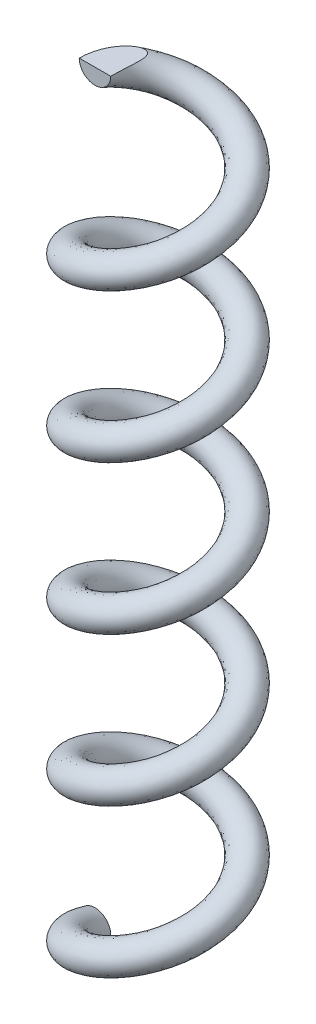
ISO-10303-21;
HEADER;
FILE_DESCRIPTION(('STEP AP214'),'2;1');
FILE_NAME('part.step','',(''),(''),'','','');
FILE_SCHEMA(('AUTOMOTIVE_DESIGN { 1 0 10303 214 1 1 1 1 }'));
ENDSEC;
DATA;
#1=APPLICATION_CONTEXT('core data for automotive mechanical design processes');
#2=APPLICATION_PROTOCOL_DEFINITION('international standard','automotive_design',2000,#1);
#3=PRODUCT_CONTEXT('',#1,'mechanical');
#4=PRODUCT('Part','Part','',(#3));
#5=PRODUCT_RELATED_PRODUCT_CATEGORY('part','',(#4));
#6=PRODUCT_DEFINITION_FORMATION('','',#4);
#7=PRODUCT_DEFINITION_CONTEXT('part definition',#1,'design');
#8=PRODUCT_DEFINITION('design','',#6,#7);
#9=PRODUCT_DEFINITION_SHAPE('','',#8);
#10=(LENGTH_UNIT() NAMED_UNIT(*) SI_UNIT(.MILLI.,.METRE.));
#11=(NAMED_UNIT(*) PLANE_ANGLE_UNIT() SI_UNIT($,.RADIAN.));
#12=(NAMED_UNIT(*) SI_UNIT($,.STERADIAN.) SOLID_ANGLE_UNIT());
#13=UNCERTAINTY_MEASURE_WITH_UNIT(LENGTH_MEASURE(1.E-05),#10,'distance_accuracy_value','');
#14=(GEOMETRIC_REPRESENTATION_CONTEXT(3) GLOBAL_UNCERTAINTY_ASSIGNED_CONTEXT((#13)) GLOBAL_UNIT_ASSIGNED_CONTEXT((#10,
#11,#12)) REPRESENTATION_CONTEXT('',''));
#15=CARTESIAN_POINT('',(0.,0.,0.));
#16=DIRECTION('',(0.,0.,1.));
#17=DIRECTION('',(1.,0.,0.));
#18=AXIS2_PLACEMENT_3D('',#15,#16,#17);
#19=CARTESIAN_POINT('',(-38.,93.7076520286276,9.77614774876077E-13));
#20=DIRECTION('',(0.,0.,1.));
#21=DIRECTION('',(1.,0.,0.));
#22=AXIS2_PLACEMENT_3D('',#19,#20,#21);
#23=PLANE('',#22);
#24=CARTESIAN_POINT('',(-38.,93.7076520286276,9.77614774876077E-13));
#25=DIRECTION('',(0.,0.,1.));
#26=DIRECTION('',(1.,0.,0.));
#27=AXIS2_PLACEMENT_3D('',#24,#25,#26);
#28=CIRCLE('',#27,3.5);
#29=CARTESIAN_POINT('',(-41.5,93.7076519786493,0.));
#30=VERTEX_POINT('',#29);
#31=CARTESIAN_POINT('',(-34.5,93.7076519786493,7.33211081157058E-13));
#32=VERTEX_POINT('',#31);
#33=EDGE_CURVE('E75',#30,#32,#28,.T.);
#34=ORIENTED_EDGE('',*,*,#33,.T.);
#35=DIRECTION('',(-1.,0.,0.));
#36=VECTOR('',#35,1.);
#37=CARTESIAN_POINT('',(-38.,93.7076519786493,9.77614774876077E-13));
#38=LINE('',#37,#36);
#39=EDGE_CURVE('E61',#32,#30,#38,.T.);
#40=ORIENTED_EDGE('',*,*,#39,.T.);
#41=EDGE_LOOP('',(#34,#40));
#42=FACE_BOUND('',#41,.T.);
#43=ADVANCED_FACE('F41',(#42),#23,.T.);
#44=CARTESIAN_POINT('',(-34.5,-71.5,0.));
#45=CARTESIAN_POINT('',(-34.5,-70.1232695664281,2.81346652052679));
#46=CARTESIAN_POINT('',(-33.0932667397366,-68.7465391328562,5.25));
#47=CARTESIAN_POINT('',(-31.6865334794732,-67.3698086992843,7.68653347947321));
#48=CARTESIAN_POINT('',(-29.25,-65.9930782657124,9.0932667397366));
#49=CARTESIAN_POINT('',(-26.8134665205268,-64.6163478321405,10.5));
#50=CARTESIAN_POINT('',(-24.,-63.2396173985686,10.5));
#51=CARTESIAN_POINT('',(-21.1865334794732,-61.8628869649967,10.5));
#52=CARTESIAN_POINT('',(-18.75,-60.4861565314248,9.0932667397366));
#53=CARTESIAN_POINT('',(-16.3134665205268,-59.1094260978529,7.68653347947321));
#54=CARTESIAN_POINT('',(-14.9067332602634,-57.7326956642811,5.25));
#55=CARTESIAN_POINT('',(-13.5,-56.3559652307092,2.81346652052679));
#56=CARTESIAN_POINT('',(-13.5,-54.9792347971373,0.));
#57=CARTESIAN_POINT('',(-13.5,-53.6025043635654,-2.81346652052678));
#58=CARTESIAN_POINT('',(-14.9067332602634,-52.2257739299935,-5.25));
#59=CARTESIAN_POINT('',(-16.3134665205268,-50.8490434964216,-7.6865334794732));
#60=CARTESIAN_POINT('',(-18.75,-49.4723130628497,-9.0932667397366));
#61=CARTESIAN_POINT('',(-21.1865334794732,-48.0955826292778,-10.5));
#62=CARTESIAN_POINT('',(-24.,-46.7188521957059,-10.5));
#63=CARTESIAN_POINT('',(-26.8134665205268,-45.342121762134,-10.5));
#64=CARTESIAN_POINT('',(-29.25,-43.9653913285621,-9.09326673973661));
#65=CARTESIAN_POINT('',(-31.6865334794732,-42.5886608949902,-7.68653347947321));
#66=CARTESIAN_POINT('',(-33.0932667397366,-41.2119304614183,-5.25));
#67=CARTESIAN_POINT('',(-34.5,-39.8352000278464,-2.8134665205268));
#68=CARTESIAN_POINT('',(-34.5,-38.4584695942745,0.));
#69=CARTESIAN_POINT('',(-34.5,-37.0817391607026,2.81346652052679));
#70=CARTESIAN_POINT('',(-33.0932667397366,-35.7050087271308,5.25));
#71=CARTESIAN_POINT('',(-31.6865334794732,-34.3282782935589,7.68653347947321));
#72=CARTESIAN_POINT('',(-29.25,-32.951547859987,9.0932667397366));
#73=CARTESIAN_POINT('',(-26.8134665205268,-31.5748174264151,10.5));
#74=CARTESIAN_POINT('',(-24.,-30.1980869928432,10.5));
#75=CARTESIAN_POINT('',(-21.1865334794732,-28.8213565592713,10.5));
#76=CARTESIAN_POINT('',(-18.75,-27.4446261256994,9.0932667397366));
#77=CARTESIAN_POINT('',(-16.3134665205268,-26.0678956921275,7.68653347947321));
#78=CARTESIAN_POINT('',(-14.9067332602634,-24.6911652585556,5.25));
#79=CARTESIAN_POINT('',(-13.5,-23.3144348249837,2.81346652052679));
#80=CARTESIAN_POINT('',(-13.5,-21.9377043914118,0.));
#81=CARTESIAN_POINT('',(-13.5,-20.5609739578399,-2.81346652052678));
#82=CARTESIAN_POINT('',(-14.9067332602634,-19.184243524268,-5.25));
#83=CARTESIAN_POINT('',(-16.3134665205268,-17.8075130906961,-7.6865334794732));
#84=CARTESIAN_POINT('',(-18.75,-16.4307826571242,-9.0932667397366));
#85=CARTESIAN_POINT('',(-21.1865334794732,-15.0540522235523,-10.5));
#86=CARTESIAN_POINT('',(-24.,-13.6773217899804,-10.5));
#87=CARTESIAN_POINT('',(-26.8134665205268,-12.3005913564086,-10.5));
#88=CARTESIAN_POINT('',(-29.25,-10.9238609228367,-9.09326673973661));
#89=CARTESIAN_POINT('',(-31.6865334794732,-9.54713048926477,-7.68653347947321));
#90=CARTESIAN_POINT('',(-33.0932667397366,-8.17040005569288,-5.25));
#91=CARTESIAN_POINT('',(-34.5,-6.79366962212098,-2.8134665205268));
#92=CARTESIAN_POINT('',(-34.5,-5.41693918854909,0.));
#93=CARTESIAN_POINT('',(-34.5,-4.0402087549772,2.81346652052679));
#94=CARTESIAN_POINT('',(-33.0932667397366,-2.6634783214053,5.25));
#95=CARTESIAN_POINT('',(-31.6865334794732,-1.28674788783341,7.68653347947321));
#96=CARTESIAN_POINT('',(-29.25,0.0899825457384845,9.0932667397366));
#97=CARTESIAN_POINT('',(-26.8134665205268,1.46671297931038,10.5));
#98=CARTESIAN_POINT('',(-24.,2.84344341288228,10.5));
#99=CARTESIAN_POINT('',(-21.1865334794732,4.22017384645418,10.5));
#100=CARTESIAN_POINT('',(-18.75,5.59690428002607,9.0932667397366));
#101=CARTESIAN_POINT('',(-16.3134665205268,6.97363471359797,7.68653347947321));
#102=CARTESIAN_POINT('',(-14.9067332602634,8.35036514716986,5.25));
#103=CARTESIAN_POINT('',(-13.5,9.72709558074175,2.81346652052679));
#104=CARTESIAN_POINT('',(-13.5,11.1038260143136,0.));
#105=CARTESIAN_POINT('',(-13.5,12.4805564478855,-2.81346652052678));
#106=CARTESIAN_POINT('',(-14.9067332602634,13.8572868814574,-5.25));
#107=CARTESIAN_POINT('',(-16.3134665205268,15.2340173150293,-7.6865334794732));
#108=CARTESIAN_POINT('',(-18.75,16.6107477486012,-9.0932667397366));
#109=CARTESIAN_POINT('',(-21.1865334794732,17.9874781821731,-10.5));
#110=CARTESIAN_POINT('',(-24.,19.364208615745,-10.5));
#111=CARTESIAN_POINT('',(-26.8134665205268,20.7409390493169,-10.5));
#112=CARTESIAN_POINT('',(-29.25,22.1176694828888,-9.09326673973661));
#113=CARTESIAN_POINT('',(-31.6865334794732,23.4943999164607,-7.68653347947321));
#114=CARTESIAN_POINT('',(-33.0932667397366,24.8711303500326,-5.25));
#115=CARTESIAN_POINT('',(-34.5,26.2478607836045,-2.8134665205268));
#116=CARTESIAN_POINT('',(-34.5,27.6245912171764,0.));
#117=CARTESIAN_POINT('',(-34.5,29.0013216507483,2.81346652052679));
#118=CARTESIAN_POINT('',(-33.0932667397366,30.3780520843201,5.25));
#119=CARTESIAN_POINT('',(-31.6865334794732,31.7547825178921,7.68653347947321));
#120=CARTESIAN_POINT('',(-29.25,33.131512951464,9.0932667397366));
#121=CARTESIAN_POINT('',(-26.8134665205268,34.5082433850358,10.5));
#122=CARTESIAN_POINT('',(-24.,35.8849738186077,10.5));
#123=CARTESIAN_POINT('',(-21.1865334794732,37.2617042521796,10.5));
#124=CARTESIAN_POINT('',(-18.75,38.6384346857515,9.0932667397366));
#125=CARTESIAN_POINT('',(-16.3134665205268,40.0151651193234,7.68653347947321));
#126=CARTESIAN_POINT('',(-14.9067332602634,41.3918955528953,5.25));
#127=CARTESIAN_POINT('',(-13.5,42.7686259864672,2.81346652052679));
#128=CARTESIAN_POINT('',(-13.5,44.1453564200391,0.));
#129=CARTESIAN_POINT('',(-13.5,45.522086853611,-2.81346652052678));
#130=CARTESIAN_POINT('',(-14.9067332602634,46.8988172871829,-5.25));
#131=CARTESIAN_POINT('',(-16.3134665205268,48.2755477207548,-7.6865334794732));
#132=CARTESIAN_POINT('',(-18.75,49.6522781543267,-9.0932667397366));
#133=CARTESIAN_POINT('',(-21.1865334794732,51.0290085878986,-10.5));
#134=CARTESIAN_POINT('',(-24.,52.4057390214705,-10.5));
#135=CARTESIAN_POINT('',(-26.8134665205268,53.7824694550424,-10.5));
#136=CARTESIAN_POINT('',(-29.25,55.1591998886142,-9.09326673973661));
#137=CARTESIAN_POINT('',(-31.6865334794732,56.5359303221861,-7.68653347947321));
#138=CARTESIAN_POINT('',(-33.0932667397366,57.912660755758,-5.25));
#139=CARTESIAN_POINT('',(-34.5,59.2893911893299,-2.8134665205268));
#140=CARTESIAN_POINT('',(-34.5,60.6661216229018,0.));
#141=CARTESIAN_POINT('',(-34.5,62.0428520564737,2.81346652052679));
#142=CARTESIAN_POINT('',(-33.0932667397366,63.4195824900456,5.25));
#143=CARTESIAN_POINT('',(-31.6865334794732,64.7963129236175,7.68653347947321));
#144=CARTESIAN_POINT('',(-29.25,66.1730433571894,9.0932667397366));
#145=CARTESIAN_POINT('',(-26.8134665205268,67.5497737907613,10.5));
#146=CARTESIAN_POINT('',(-24.,68.9265042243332,10.5));
#147=CARTESIAN_POINT('',(-21.1865334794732,70.3032346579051,10.5));
#148=CARTESIAN_POINT('',(-18.75,71.679965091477,9.0932667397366));
#149=CARTESIAN_POINT('',(-16.3134665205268,73.0566955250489,7.68653347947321));
#150=CARTESIAN_POINT('',(-14.9067332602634,74.4334259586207,5.25));
#151=CARTESIAN_POINT('',(-13.5,75.8101563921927,2.81346652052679));
#152=CARTESIAN_POINT('',(-13.5,77.1868868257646,0.));
#153=CARTESIAN_POINT('',(-13.5,78.5636172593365,-2.81346652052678));
#154=CARTESIAN_POINT('',(-14.9067332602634,79.9403476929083,-5.25));
#155=CARTESIAN_POINT('',(-16.3134665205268,81.3170781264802,-7.6865334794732));
#156=CARTESIAN_POINT('',(-18.75,82.6938085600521,-9.0932667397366));
#157=CARTESIAN_POINT('',(-21.1865334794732,84.070538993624,-10.5));
#158=CARTESIAN_POINT('',(-24.,85.4472694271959,-10.5));
#159=CARTESIAN_POINT('',(-26.8134665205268,86.8239998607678,-10.5));
#160=CARTESIAN_POINT('',(-29.25,88.2007302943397,-9.09326673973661));
#161=CARTESIAN_POINT('',(-31.6865334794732,89.5774607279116,-7.68653347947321));
#162=CARTESIAN_POINT('',(-33.0932667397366,90.9541911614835,-5.25));
#163=CARTESIAN_POINT('',(-34.5,92.3309215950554,-2.8134665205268));
#164=CARTESIAN_POINT('',(-34.5,93.7076520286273,0.));
#165=CARTESIAN_POINT('',(-34.5,-64.5,0.));
#166=CARTESIAN_POINT('',(-34.5,-63.1232695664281,2.81346652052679));
#167=CARTESIAN_POINT('',(-33.0932667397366,-61.7465391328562,5.25));
#168=CARTESIAN_POINT('',(-31.6865334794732,-60.3698086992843,7.68653347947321));
#169=CARTESIAN_POINT('',(-29.25,-58.9930782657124,9.0932667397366));
#170=CARTESIAN_POINT('',(-26.8134665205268,-57.6163478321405,10.5));
#171=CARTESIAN_POINT('',(-24.,-56.2396173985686,10.5));
#172=CARTESIAN_POINT('',(-21.1865334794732,-54.8628869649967,10.5));
#173=CARTESIAN_POINT('',(-18.75,-53.4861565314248,9.0932667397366));
#174=CARTESIAN_POINT('',(-16.3134665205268,-52.1094260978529,7.68653347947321));
#175=CARTESIAN_POINT('',(-14.9067332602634,-50.7326956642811,5.25));
#176=CARTESIAN_POINT('',(-13.5,-49.3559652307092,2.81346652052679));
#177=CARTESIAN_POINT('',(-13.5,-47.9792347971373,0.));
#178=CARTESIAN_POINT('',(-13.5,-46.6025043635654,-2.81346652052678));
#179=CARTESIAN_POINT('',(-14.9067332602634,-45.2257739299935,-5.25));
#180=CARTESIAN_POINT('',(-16.3134665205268,-43.8490434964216,-7.68653347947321));
#181=CARTESIAN_POINT('',(-18.75,-42.4723130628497,-9.0932667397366));
#182=CARTESIAN_POINT('',(-21.1865334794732,-41.0955826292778,-10.5));
#183=CARTESIAN_POINT('',(-24.,-39.7188521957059,-10.5));
#184=CARTESIAN_POINT('',(-26.8134665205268,-38.342121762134,-10.5));
#185=CARTESIAN_POINT('',(-29.25,-36.9653913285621,-9.09326673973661));
#186=CARTESIAN_POINT('',(-31.6865334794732,-35.5886608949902,-7.68653347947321));
#187=CARTESIAN_POINT('',(-33.0932667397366,-34.2119304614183,-5.25));
#188=CARTESIAN_POINT('',(-34.5,-32.8352000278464,-2.8134665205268));
#189=CARTESIAN_POINT('',(-34.5,-31.4584695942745,0.));
#190=CARTESIAN_POINT('',(-34.5,-30.0817391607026,2.81346652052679));
#191=CARTESIAN_POINT('',(-33.0932667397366,-28.7050087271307,5.25));
#192=CARTESIAN_POINT('',(-31.6865334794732,-27.3282782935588,7.68653347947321));
#193=CARTESIAN_POINT('',(-29.25,-25.951547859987,9.0932667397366));
#194=CARTESIAN_POINT('',(-26.8134665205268,-24.5748174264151,10.5));
#195=CARTESIAN_POINT('',(-24.,-23.1980869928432,10.5));
#196=CARTESIAN_POINT('',(-21.1865334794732,-21.8213565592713,10.5));
#197=CARTESIAN_POINT('',(-18.75,-20.4446261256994,9.0932667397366));
#198=CARTESIAN_POINT('',(-16.3134665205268,-19.0678956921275,7.68653347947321));
#199=CARTESIAN_POINT('',(-14.9067332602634,-17.6911652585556,5.25));
#200=CARTESIAN_POINT('',(-13.5,-16.3144348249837,2.81346652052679));
#201=CARTESIAN_POINT('',(-13.5,-14.9377043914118,0.));
#202=CARTESIAN_POINT('',(-13.5,-13.5609739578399,-2.81346652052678));
#203=CARTESIAN_POINT('',(-14.9067332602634,-12.184243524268,-5.25));
#204=CARTESIAN_POINT('',(-16.3134665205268,-10.8075130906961,-7.68653347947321));
#205=CARTESIAN_POINT('',(-18.75,-9.43078265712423,-9.0932667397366));
#206=CARTESIAN_POINT('',(-21.1865334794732,-8.05405222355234,-10.5));
#207=CARTESIAN_POINT('',(-24.,-6.67732178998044,-10.5));
#208=CARTESIAN_POINT('',(-26.8134665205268,-5.30059135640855,-10.5));
#209=CARTESIAN_POINT('',(-29.25,-3.92386092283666,-9.09326673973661));
#210=CARTESIAN_POINT('',(-31.6865334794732,-2.54713048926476,-7.68653347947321));
#211=CARTESIAN_POINT('',(-33.0932667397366,-1.17040005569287,-5.25));
#212=CARTESIAN_POINT('',(-34.5,0.206330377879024,-2.8134665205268));
#213=CARTESIAN_POINT('',(-34.5,1.58306081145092,0.));
#214=CARTESIAN_POINT('',(-34.5,2.95979124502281,2.81346652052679));
#215=CARTESIAN_POINT('',(-33.0932667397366,4.3365216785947,5.25));
#216=CARTESIAN_POINT('',(-31.6865334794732,5.7132521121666,7.68653347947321));
#217=CARTESIAN_POINT('',(-29.25,7.08998254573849,9.0932667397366));
#218=CARTESIAN_POINT('',(-26.8134665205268,8.46671297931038,10.5));
#219=CARTESIAN_POINT('',(-24.,9.84344341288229,10.5));
#220=CARTESIAN_POINT('',(-21.1865334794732,11.2201738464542,10.5));
#221=CARTESIAN_POINT('',(-18.75,12.5969042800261,9.0932667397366));
#222=CARTESIAN_POINT('',(-16.3134665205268,13.973634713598,7.68653347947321));
#223=CARTESIAN_POINT('',(-14.9067332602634,15.3503651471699,5.25));
#224=CARTESIAN_POINT('',(-13.5,16.7270955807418,2.81346652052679));
#225=CARTESIAN_POINT('',(-13.5,18.1038260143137,0.));
#226=CARTESIAN_POINT('',(-13.5,19.4805564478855,-2.81346652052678));
#227=CARTESIAN_POINT('',(-14.9067332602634,20.8572868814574,-5.25));
#228=CARTESIAN_POINT('',(-16.3134665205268,22.2340173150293,-7.68653347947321));
#229=CARTESIAN_POINT('',(-18.75,23.6107477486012,-9.0932667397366));
#230=CARTESIAN_POINT('',(-21.1865334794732,24.9874781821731,-10.5));
#231=CARTESIAN_POINT('',(-24.,26.364208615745,-10.5));
#232=CARTESIAN_POINT('',(-26.8134665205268,27.7409390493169,-10.5));
#233=CARTESIAN_POINT('',(-29.25,29.1176694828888,-9.09326673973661));
#234=CARTESIAN_POINT('',(-31.6865334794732,30.4943999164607,-7.68653347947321));
#235=CARTESIAN_POINT('',(-33.0932667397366,31.8711303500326,-5.25));
#236=CARTESIAN_POINT('',(-34.5,33.2478607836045,-2.8134665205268));
#237=CARTESIAN_POINT('',(-34.5,34.6245912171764,0.));
#238=CARTESIAN_POINT('',(-34.5,36.0013216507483,2.81346652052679));
#239=CARTESIAN_POINT('',(-33.0932667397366,37.3780520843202,5.25));
#240=CARTESIAN_POINT('',(-31.6865334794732,38.7547825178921,7.68653347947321));
#241=CARTESIAN_POINT('',(-29.25,40.131512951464,9.0932667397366));
#242=CARTESIAN_POINT('',(-26.8134665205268,41.5082433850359,10.5));
#243=CARTESIAN_POINT('',(-24.,42.8849738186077,10.5));
#244=CARTESIAN_POINT('',(-21.1865334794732,44.2617042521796,10.5));
#245=CARTESIAN_POINT('',(-18.75,45.6384346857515,9.0932667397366));
#246=CARTESIAN_POINT('',(-16.3134665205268,47.0151651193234,7.68653347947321));
#247=CARTESIAN_POINT('',(-14.9067332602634,48.3918955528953,5.25));
#248=CARTESIAN_POINT('',(-13.5,49.7686259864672,2.81346652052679));
#249=CARTESIAN_POINT('',(-13.5,51.1453564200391,0.));
#250=CARTESIAN_POINT('',(-13.5,52.522086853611,-2.81346652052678));
#251=CARTESIAN_POINT('',(-14.9067332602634,53.8988172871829,-5.25));
#252=CARTESIAN_POINT('',(-16.3134665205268,55.2755477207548,-7.68653347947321));
#253=CARTESIAN_POINT('',(-18.75,56.6522781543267,-9.0932667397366));
#254=CARTESIAN_POINT('',(-21.1865334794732,58.0290085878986,-10.5));
#255=CARTESIAN_POINT('',(-24.,59.4057390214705,-10.5));
#256=CARTESIAN_POINT('',(-26.8134665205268,60.7824694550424,-10.5));
#257=CARTESIAN_POINT('',(-29.25,62.1591998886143,-9.09326673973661));
#258=CARTESIAN_POINT('',(-31.6865334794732,63.5359303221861,-7.68653347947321));
#259=CARTESIAN_POINT('',(-33.0932667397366,64.912660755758,-5.25));
#260=CARTESIAN_POINT('',(-34.5,66.2893911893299,-2.8134665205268));
#261=CARTESIAN_POINT('',(-34.5,67.6661216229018,0.));
#262=CARTESIAN_POINT('',(-34.5,69.0428520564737,2.81346652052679));
#263=CARTESIAN_POINT('',(-33.0932667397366,70.4195824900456,5.25));
#264=CARTESIAN_POINT('',(-31.6865334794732,71.7963129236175,7.68653347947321));
#265=CARTESIAN_POINT('',(-29.25,73.1730433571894,9.0932667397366));
#266=CARTESIAN_POINT('',(-26.8134665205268,74.5497737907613,10.5));
#267=CARTESIAN_POINT('',(-24.,75.9265042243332,10.5));
#268=CARTESIAN_POINT('',(-21.1865334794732,77.3032346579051,10.5));
#269=CARTESIAN_POINT('',(-18.75,78.679965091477,9.0932667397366));
#270=CARTESIAN_POINT('',(-16.3134665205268,80.0566955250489,7.68653347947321));
#271=CARTESIAN_POINT('',(-14.9067332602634,81.4334259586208,5.25));
#272=CARTESIAN_POINT('',(-13.5,82.8101563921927,2.81346652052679));
#273=CARTESIAN_POINT('',(-13.5,84.1868868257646,0.));
#274=CARTESIAN_POINT('',(-13.5,85.5636172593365,-2.81346652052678));
#275=CARTESIAN_POINT('',(-14.9067332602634,86.9403476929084,-5.25));
#276=CARTESIAN_POINT('',(-16.3134665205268,88.3170781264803,-7.68653347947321));
#277=CARTESIAN_POINT('',(-18.75,89.6938085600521,-9.0932667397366));
#278=CARTESIAN_POINT('',(-21.1865334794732,91.0705389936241,-10.5));
#279=CARTESIAN_POINT('',(-24.,92.4472694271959,-10.5));
#280=CARTESIAN_POINT('',(-26.8134665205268,93.8239998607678,-10.5));
#281=CARTESIAN_POINT('',(-29.25,95.2007302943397,-9.09326673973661));
#282=CARTESIAN_POINT('',(-31.6865334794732,96.5774607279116,-7.68653347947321));
#283=CARTESIAN_POINT('',(-33.0932667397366,97.9541911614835,-5.25));
#284=CARTESIAN_POINT('',(-34.5,99.3309215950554,-2.8134665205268));
#285=CARTESIAN_POINT('',(-34.5,100.707652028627,0.));
#286=CARTESIAN_POINT('',(-41.5,-64.5,0.));
#287=CARTESIAN_POINT('',(-41.5,-63.1232695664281,4.68911086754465));
#288=CARTESIAN_POINT('',(-39.1554445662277,-61.7465391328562,8.75));
#289=CARTESIAN_POINT('',(-36.8108891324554,-60.3698086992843,12.8108891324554));
#290=CARTESIAN_POINT('',(-32.75,-58.9930782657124,15.1554445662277));
#291=CARTESIAN_POINT('',(-28.6891108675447,-57.6163478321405,17.5));
#292=CARTESIAN_POINT('',(-24.,-56.2396173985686,17.5));
#293=CARTESIAN_POINT('',(-19.3108891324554,-54.8628869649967,17.5));
#294=CARTESIAN_POINT('',(-15.25,-53.4861565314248,15.1554445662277));
#295=CARTESIAN_POINT('',(-11.1891108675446,-52.1094260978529,12.8108891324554));
#296=CARTESIAN_POINT('',(-8.84455543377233,-50.7326956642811,8.75000000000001));
#297=CARTESIAN_POINT('',(-6.5,-49.3559652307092,4.68911086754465));
#298=CARTESIAN_POINT('',(-6.5,-47.9792347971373,0.));
#299=CARTESIAN_POINT('',(-6.5,-46.6025043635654,-4.68911086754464));
#300=CARTESIAN_POINT('',(-8.84455543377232,-45.2257739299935,-8.75));
#301=CARTESIAN_POINT('',(-11.1891108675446,-43.8490434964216,-12.8108891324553));
#302=CARTESIAN_POINT('',(-15.25,-42.4723130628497,-15.1554445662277));
#303=CARTESIAN_POINT('',(-19.3108891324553,-41.0955826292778,-17.5));
#304=CARTESIAN_POINT('',(-24.,-39.7188521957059,-17.5));
#305=CARTESIAN_POINT('',(-28.6891108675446,-38.342121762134,-17.5));
#306=CARTESIAN_POINT('',(-32.75,-36.9653913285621,-15.1554445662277));
#307=CARTESIAN_POINT('',(-36.8108891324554,-35.5886608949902,-12.8108891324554));
#308=CARTESIAN_POINT('',(-39.1554445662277,-34.2119304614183,-8.75000000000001));
#309=CARTESIAN_POINT('',(-41.5,-32.8352000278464,-4.68911086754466));
#310=CARTESIAN_POINT('',(-41.5,-31.4584695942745,0.));
#311=CARTESIAN_POINT('',(-41.5,-30.0817391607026,4.68911086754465));
#312=CARTESIAN_POINT('',(-39.1554445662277,-28.7050087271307,8.75));
#313=CARTESIAN_POINT('',(-36.8108891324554,-27.3282782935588,12.8108891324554));
#314=CARTESIAN_POINT('',(-32.75,-25.951547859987,15.1554445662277));
#315=CARTESIAN_POINT('',(-28.6891108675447,-24.5748174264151,17.5));
#316=CARTESIAN_POINT('',(-24.,-23.1980869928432,17.5));
#317=CARTESIAN_POINT('',(-19.3108891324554,-21.8213565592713,17.5));
#318=CARTESIAN_POINT('',(-15.25,-20.4446261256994,15.1554445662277));
#319=CARTESIAN_POINT('',(-11.1891108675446,-19.0678956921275,12.8108891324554));
#320=CARTESIAN_POINT('',(-8.84455543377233,-17.6911652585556,8.75000000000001));
#321=CARTESIAN_POINT('',(-6.5,-16.3144348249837,4.68911086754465));
#322=CARTESIAN_POINT('',(-6.5,-14.9377043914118,0.));
#323=CARTESIAN_POINT('',(-6.5,-13.5609739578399,-4.68911086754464));
#324=CARTESIAN_POINT('',(-8.84455543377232,-12.184243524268,-8.75));
#325=CARTESIAN_POINT('',(-11.1891108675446,-10.8075130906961,-12.8108891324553));
#326=CARTESIAN_POINT('',(-15.25,-9.43078265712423,-15.1554445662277));
#327=CARTESIAN_POINT('',(-19.3108891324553,-8.05405222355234,-17.5));
#328=CARTESIAN_POINT('',(-24.,-6.67732178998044,-17.5));
#329=CARTESIAN_POINT('',(-28.6891108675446,-5.30059135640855,-17.5));
#330=CARTESIAN_POINT('',(-32.75,-3.92386092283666,-15.1554445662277));
#331=CARTESIAN_POINT('',(-36.8108891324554,-2.54713048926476,-12.8108891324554));
#332=CARTESIAN_POINT('',(-39.1554445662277,-1.17040005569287,-8.75000000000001));
#333=CARTESIAN_POINT('',(-41.5,0.206330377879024,-4.68911086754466));
#334=CARTESIAN_POINT('',(-41.5,1.58306081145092,0.));
#335=CARTESIAN_POINT('',(-41.5,2.95979124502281,4.68911086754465));
#336=CARTESIAN_POINT('',(-39.1554445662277,4.3365216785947,8.75));
#337=CARTESIAN_POINT('',(-36.8108891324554,5.7132521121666,12.8108891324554));
#338=CARTESIAN_POINT('',(-32.75,7.08998254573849,15.1554445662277));
#339=CARTESIAN_POINT('',(-28.6891108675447,8.46671297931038,17.5));
#340=CARTESIAN_POINT('',(-24.,9.84344341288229,17.5));
#341=CARTESIAN_POINT('',(-19.3108891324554,11.2201738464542,17.5));
#342=CARTESIAN_POINT('',(-15.25,12.5969042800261,15.1554445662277));
#343=CARTESIAN_POINT('',(-11.1891108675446,13.973634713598,12.8108891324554));
#344=CARTESIAN_POINT('',(-8.84455543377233,15.3503651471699,8.75000000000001));
#345=CARTESIAN_POINT('',(-6.5,16.7270955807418,4.68911086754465));
#346=CARTESIAN_POINT('',(-6.5,18.1038260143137,0.));
#347=CARTESIAN_POINT('',(-6.5,19.4805564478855,-4.68911086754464));
#348=CARTESIAN_POINT('',(-8.84455543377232,20.8572868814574,-8.75));
#349=CARTESIAN_POINT('',(-11.1891108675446,22.2340173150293,-12.8108891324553));
#350=CARTESIAN_POINT('',(-15.25,23.6107477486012,-15.1554445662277));
#351=CARTESIAN_POINT('',(-19.3108891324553,24.9874781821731,-17.5));
#352=CARTESIAN_POINT('',(-24.,26.364208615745,-17.5));
#353=CARTESIAN_POINT('',(-28.6891108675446,27.7409390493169,-17.5));
#354=CARTESIAN_POINT('',(-32.75,29.1176694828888,-15.1554445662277));
#355=CARTESIAN_POINT('',(-36.8108891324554,30.4943999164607,-12.8108891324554));
#356=CARTESIAN_POINT('',(-39.1554445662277,31.8711303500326,-8.75000000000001));
#357=CARTESIAN_POINT('',(-41.5,33.2478607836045,-4.68911086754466));
#358=CARTESIAN_POINT('',(-41.5,34.6245912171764,0.));
#359=CARTESIAN_POINT('',(-41.5,36.0013216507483,4.68911086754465));
#360=CARTESIAN_POINT('',(-39.1554445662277,37.3780520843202,8.75));
#361=CARTESIAN_POINT('',(-36.8108891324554,38.7547825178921,12.8108891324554));
#362=CARTESIAN_POINT('',(-32.75,40.131512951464,15.1554445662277));
#363=CARTESIAN_POINT('',(-28.6891108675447,41.5082433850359,17.5));
#364=CARTESIAN_POINT('',(-24.,42.8849738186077,17.5));
#365=CARTESIAN_POINT('',(-19.3108891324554,44.2617042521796,17.5));
#366=CARTESIAN_POINT('',(-15.25,45.6384346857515,15.1554445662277));
#367=CARTESIAN_POINT('',(-11.1891108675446,47.0151651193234,12.8108891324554));
#368=CARTESIAN_POINT('',(-8.84455543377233,48.3918955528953,8.75000000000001));
#369=CARTESIAN_POINT('',(-6.5,49.7686259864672,4.68911086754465));
#370=CARTESIAN_POINT('',(-6.5,51.1453564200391,0.));
#371=CARTESIAN_POINT('',(-6.5,52.522086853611,-4.68911086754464));
#372=CARTESIAN_POINT('',(-8.84455543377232,53.8988172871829,-8.75));
#373=CARTESIAN_POINT('',(-11.1891108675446,55.2755477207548,-12.8108891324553));
#374=CARTESIAN_POINT('',(-15.25,56.6522781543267,-15.1554445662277));
#375=CARTESIAN_POINT('',(-19.3108891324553,58.0290085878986,-17.5));
#376=CARTESIAN_POINT('',(-24.,59.4057390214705,-17.5));
#377=CARTESIAN_POINT('',(-28.6891108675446,60.7824694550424,-17.5));
#378=CARTESIAN_POINT('',(-32.75,62.1591998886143,-15.1554445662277));
#379=CARTESIAN_POINT('',(-36.8108891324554,63.5359303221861,-12.8108891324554));
#380=CARTESIAN_POINT('',(-39.1554445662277,64.912660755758,-8.75000000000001));
#381=CARTESIAN_POINT('',(-41.5,66.2893911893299,-4.68911086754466));
#382=CARTESIAN_POINT('',(-41.5,67.6661216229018,0.));
#383=CARTESIAN_POINT('',(-41.5,69.0428520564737,4.68911086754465));
#384=CARTESIAN_POINT('',(-39.1554445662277,70.4195824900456,8.75));
#385=CARTESIAN_POINT('',(-36.8108891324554,71.7963129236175,12.8108891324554));
#386=CARTESIAN_POINT('',(-32.75,73.1730433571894,15.1554445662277));
#387=CARTESIAN_POINT('',(-28.6891108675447,74.5497737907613,17.5));
#388=CARTESIAN_POINT('',(-24.,75.9265042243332,17.5));
#389=CARTESIAN_POINT('',(-19.3108891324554,77.3032346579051,17.5));
#390=CARTESIAN_POINT('',(-15.25,78.679965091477,15.1554445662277));
#391=CARTESIAN_POINT('',(-11.1891108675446,80.0566955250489,12.8108891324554));
#392=CARTESIAN_POINT('',(-8.84455543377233,81.4334259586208,8.75000000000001));
#393=CARTESIAN_POINT('',(-6.5,82.8101563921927,4.68911086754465));
#394=CARTESIAN_POINT('',(-6.5,84.1868868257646,0.));
#395=CARTESIAN_POINT('',(-6.5,85.5636172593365,-4.68911086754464));
#396=CARTESIAN_POINT('',(-8.84455543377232,86.9403476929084,-8.75));
#397=CARTESIAN_POINT('',(-11.1891108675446,88.3170781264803,-12.8108891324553));
#398=CARTESIAN_POINT('',(-15.25,89.6938085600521,-15.1554445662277));
#399=CARTESIAN_POINT('',(-19.3108891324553,91.0705389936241,-17.5));
#400=CARTESIAN_POINT('',(-24.,92.4472694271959,-17.5));
#401=CARTESIAN_POINT('',(-28.6891108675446,93.8239998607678,-17.5));
#402=CARTESIAN_POINT('',(-32.75,95.2007302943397,-15.1554445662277));
#403=CARTESIAN_POINT('',(-36.8108891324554,96.5774607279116,-12.8108891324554));
#404=CARTESIAN_POINT('',(-39.1554445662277,97.9541911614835,-8.75000000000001));
#405=CARTESIAN_POINT('',(-41.5,99.3309215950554,-4.68911086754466));
#406=CARTESIAN_POINT('',(-41.5,100.707652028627,0.));
#407=CARTESIAN_POINT('',(-41.5,-71.5,0.));
#408=CARTESIAN_POINT('',(-41.5,-70.1232695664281,4.68911086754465));
#409=CARTESIAN_POINT('',(-39.1554445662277,-68.7465391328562,8.75));
#410=CARTESIAN_POINT('',(-36.8108891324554,-67.3698086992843,12.8108891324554));
#411=CARTESIAN_POINT('',(-32.75,-65.9930782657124,15.1554445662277));
#412=CARTESIAN_POINT('',(-28.6891108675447,-64.6163478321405,17.5));
#413=CARTESIAN_POINT('',(-24.,-63.2396173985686,17.5));
#414=CARTESIAN_POINT('',(-19.3108891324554,-61.8628869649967,17.5));
#415=CARTESIAN_POINT('',(-15.25,-60.4861565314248,15.1554445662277));
#416=CARTESIAN_POINT('',(-11.1891108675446,-59.1094260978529,12.8108891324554));
#417=CARTESIAN_POINT('',(-8.84455543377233,-57.7326956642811,8.75000000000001));
#418=CARTESIAN_POINT('',(-6.5,-56.3559652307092,4.68911086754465));
#419=CARTESIAN_POINT('',(-6.5,-54.9792347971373,0.));
#420=CARTESIAN_POINT('',(-6.5,-53.6025043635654,-4.68911086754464));
#421=CARTESIAN_POINT('',(-8.84455543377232,-52.2257739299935,-8.75));
#422=CARTESIAN_POINT('',(-11.1891108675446,-50.8490434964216,-12.8108891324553));
#423=CARTESIAN_POINT('',(-15.25,-49.4723130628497,-15.1554445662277));
#424=CARTESIAN_POINT('',(-19.3108891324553,-48.0955826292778,-17.5));
#425=CARTESIAN_POINT('',(-24.,-46.7188521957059,-17.5));
#426=CARTESIAN_POINT('',(-28.6891108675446,-45.342121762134,-17.5));
#427=CARTESIAN_POINT('',(-32.75,-43.9653913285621,-15.1554445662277));
#428=CARTESIAN_POINT('',(-36.8108891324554,-42.5886608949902,-12.8108891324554));
#429=CARTESIAN_POINT('',(-39.1554445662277,-41.2119304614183,-8.75000000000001));
#430=CARTESIAN_POINT('',(-41.5,-39.8352000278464,-4.68911086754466));
#431=CARTESIAN_POINT('',(-41.5,-38.4584695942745,0.));
#432=CARTESIAN_POINT('',(-41.5,-37.0817391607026,4.68911086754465));
#433=CARTESIAN_POINT('',(-39.1554445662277,-35.7050087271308,8.75));
#434=CARTESIAN_POINT('',(-36.8108891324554,-34.3282782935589,12.8108891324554));
#435=CARTESIAN_POINT('',(-32.75,-32.951547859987,15.1554445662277));
#436=CARTESIAN_POINT('',(-28.6891108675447,-31.5748174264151,17.5));
#437=CARTESIAN_POINT('',(-24.,-30.1980869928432,17.5));
#438=CARTESIAN_POINT('',(-19.3108891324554,-28.8213565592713,17.5));
#439=CARTESIAN_POINT('',(-15.25,-27.4446261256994,15.1554445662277));
#440=CARTESIAN_POINT('',(-11.1891108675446,-26.0678956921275,12.8108891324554));
#441=CARTESIAN_POINT('',(-8.84455543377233,-24.6911652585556,8.75000000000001));
#442=CARTESIAN_POINT('',(-6.5,-23.3144348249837,4.68911086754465));
#443=CARTESIAN_POINT('',(-6.5,-21.9377043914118,0.));
#444=CARTESIAN_POINT('',(-6.5,-20.5609739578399,-4.68911086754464));
#445=CARTESIAN_POINT('',(-8.84455543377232,-19.184243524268,-8.75));
#446=CARTESIAN_POINT('',(-11.1891108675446,-17.8075130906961,-12.8108891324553));
#447=CARTESIAN_POINT('',(-15.25,-16.4307826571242,-15.1554445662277));
#448=CARTESIAN_POINT('',(-19.3108891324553,-15.0540522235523,-17.5));
#449=CARTESIAN_POINT('',(-24.,-13.6773217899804,-17.5));
#450=CARTESIAN_POINT('',(-28.6891108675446,-12.3005913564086,-17.5));
#451=CARTESIAN_POINT('',(-32.75,-10.9238609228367,-15.1554445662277));
#452=CARTESIAN_POINT('',(-36.8108891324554,-9.54713048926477,-12.8108891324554));
#453=CARTESIAN_POINT('',(-39.1554445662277,-8.17040005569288,-8.75000000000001));
#454=CARTESIAN_POINT('',(-41.5,-6.79366962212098,-4.68911086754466));
#455=CARTESIAN_POINT('',(-41.5,-5.41693918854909,0.));
#456=CARTESIAN_POINT('',(-41.5,-4.0402087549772,4.68911086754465));
#457=CARTESIAN_POINT('',(-39.1554445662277,-2.6634783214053,8.75));
#458=CARTESIAN_POINT('',(-36.8108891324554,-1.28674788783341,12.8108891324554));
#459=CARTESIAN_POINT('',(-32.75,0.0899825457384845,15.1554445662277));
#460=CARTESIAN_POINT('',(-28.6891108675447,1.46671297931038,17.5));
#461=CARTESIAN_POINT('',(-24.,2.84344341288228,17.5));
#462=CARTESIAN_POINT('',(-19.3108891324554,4.22017384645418,17.5));
#463=CARTESIAN_POINT('',(-15.25,5.59690428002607,15.1554445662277));
#464=CARTESIAN_POINT('',(-11.1891108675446,6.97363471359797,12.8108891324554));
#465=CARTESIAN_POINT('',(-8.84455543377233,8.35036514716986,8.75000000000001));
#466=CARTESIAN_POINT('',(-6.5,9.72709558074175,4.68911086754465));
#467=CARTESIAN_POINT('',(-6.5,11.1038260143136,0.));
#468=CARTESIAN_POINT('',(-6.5,12.4805564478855,-4.68911086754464));
#469=CARTESIAN_POINT('',(-8.84455543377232,13.8572868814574,-8.75));
#470=CARTESIAN_POINT('',(-11.1891108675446,15.2340173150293,-12.8108891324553));
#471=CARTESIAN_POINT('',(-15.25,16.6107477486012,-15.1554445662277));
#472=CARTESIAN_POINT('',(-19.3108891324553,17.9874781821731,-17.5));
#473=CARTESIAN_POINT('',(-24.,19.364208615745,-17.5));
#474=CARTESIAN_POINT('',(-28.6891108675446,20.7409390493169,-17.5));
#475=CARTESIAN_POINT('',(-32.75,22.1176694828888,-15.1554445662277));
#476=CARTESIAN_POINT('',(-36.8108891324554,23.4943999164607,-12.8108891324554));
#477=CARTESIAN_POINT('',(-39.1554445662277,24.8711303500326,-8.75000000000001));
#478=CARTESIAN_POINT('',(-41.5,26.2478607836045,-4.68911086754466));
#479=CARTESIAN_POINT('',(-41.5,27.6245912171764,0.));
#480=CARTESIAN_POINT('',(-41.5,29.0013216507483,4.68911086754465));
#481=CARTESIAN_POINT('',(-39.1554445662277,30.3780520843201,8.75));
#482=CARTESIAN_POINT('',(-36.8108891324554,31.7547825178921,12.8108891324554));
#483=CARTESIAN_POINT('',(-32.75,33.131512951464,15.1554445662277));
#484=CARTESIAN_POINT('',(-28.6891108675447,34.5082433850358,17.5));
#485=CARTESIAN_POINT('',(-24.,35.8849738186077,17.5));
#486=CARTESIAN_POINT('',(-19.3108891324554,37.2617042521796,17.5));
#487=CARTESIAN_POINT('',(-15.25,38.6384346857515,15.1554445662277));
#488=CARTESIAN_POINT('',(-11.1891108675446,40.0151651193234,12.8108891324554));
#489=CARTESIAN_POINT('',(-8.84455543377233,41.3918955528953,8.75000000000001));
#490=CARTESIAN_POINT('',(-6.5,42.7686259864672,4.68911086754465));
#491=CARTESIAN_POINT('',(-6.5,44.1453564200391,0.));
#492=CARTESIAN_POINT('',(-6.5,45.522086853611,-4.68911086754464));
#493=CARTESIAN_POINT('',(-8.84455543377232,46.8988172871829,-8.75));
#494=CARTESIAN_POINT('',(-11.1891108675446,48.2755477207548,-12.8108891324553));
#495=CARTESIAN_POINT('',(-15.25,49.6522781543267,-15.1554445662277));
#496=CARTESIAN_POINT('',(-19.3108891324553,51.0290085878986,-17.5));
#497=CARTESIAN_POINT('',(-24.,52.4057390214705,-17.5));
#498=CARTESIAN_POINT('',(-28.6891108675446,53.7824694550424,-17.5));
#499=CARTESIAN_POINT('',(-32.75,55.1591998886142,-15.1554445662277));
#500=CARTESIAN_POINT('',(-36.8108891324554,56.5359303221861,-12.8108891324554));
#501=CARTESIAN_POINT('',(-39.1554445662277,57.912660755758,-8.75000000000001));
#502=CARTESIAN_POINT('',(-41.5,59.2893911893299,-4.68911086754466));
#503=CARTESIAN_POINT('',(-41.5,60.6661216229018,0.));
#504=CARTESIAN_POINT('',(-41.5,62.0428520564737,4.68911086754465));
#505=CARTESIAN_POINT('',(-39.1554445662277,63.4195824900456,8.75));
#506=CARTESIAN_POINT('',(-36.8108891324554,64.7963129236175,12.8108891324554));
#507=CARTESIAN_POINT('',(-32.75,66.1730433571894,15.1554445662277));
#508=CARTESIAN_POINT('',(-28.6891108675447,67.5497737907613,17.5));
#509=CARTESIAN_POINT('',(-24.,68.9265042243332,17.5));
#510=CARTESIAN_POINT('',(-19.3108891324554,70.3032346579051,17.5));
#511=CARTESIAN_POINT('',(-15.25,71.679965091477,15.1554445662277));
#512=CARTESIAN_POINT('',(-11.1891108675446,73.0566955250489,12.8108891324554));
#513=CARTESIAN_POINT('',(-8.84455543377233,74.4334259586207,8.75000000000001));
#514=CARTESIAN_POINT('',(-6.5,75.8101563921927,4.68911086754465));
#515=CARTESIAN_POINT('',(-6.5,77.1868868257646,0.));
#516=CARTESIAN_POINT('',(-6.5,78.5636172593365,-4.68911086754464));
#517=CARTESIAN_POINT('',(-8.84455543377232,79.9403476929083,-8.75));
#518=CARTESIAN_POINT('',(-11.1891108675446,81.3170781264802,-12.8108891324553));
#519=CARTESIAN_POINT('',(-15.25,82.6938085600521,-15.1554445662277));
#520=CARTESIAN_POINT('',(-19.3108891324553,84.070538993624,-17.5));
#521=CARTESIAN_POINT('',(-24.,85.4472694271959,-17.5));
#522=CARTESIAN_POINT('',(-28.6891108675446,86.8239998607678,-17.5));
#523=CARTESIAN_POINT('',(-32.75,88.2007302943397,-15.1554445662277));
#524=CARTESIAN_POINT('',(-36.8108891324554,89.5774607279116,-12.8108891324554));
#525=CARTESIAN_POINT('',(-39.1554445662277,90.9541911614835,-8.75000000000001));
#526=CARTESIAN_POINT('',(-41.5,92.3309215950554,-4.68911086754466));
#527=CARTESIAN_POINT('',(-41.5,93.7076520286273,0.));
#528=CARTESIAN_POINT('',(-41.5,-78.5,0.));
#529=CARTESIAN_POINT('',(-41.5,-77.1232695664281,4.68911086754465));
#530=CARTESIAN_POINT('',(-39.1554445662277,-75.7465391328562,8.75));
#531=CARTESIAN_POINT('',(-36.8108891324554,-74.3698086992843,12.8108891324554));
#532=CARTESIAN_POINT('',(-32.75,-72.9930782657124,15.1554445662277));
#533=CARTESIAN_POINT('',(-28.6891108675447,-71.6163478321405,17.5));
#534=CARTESIAN_POINT('',(-24.,-70.2396173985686,17.5));
#535=CARTESIAN_POINT('',(-19.3108891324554,-68.8628869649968,17.5));
#536=CARTESIAN_POINT('',(-15.25,-67.4861565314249,15.1554445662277));
#537=CARTESIAN_POINT('',(-11.1891108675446,-66.109426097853,12.8108891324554));
#538=CARTESIAN_POINT('',(-8.84455543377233,-64.7326956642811,8.75000000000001));
#539=CARTESIAN_POINT('',(-6.5,-63.3559652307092,4.68911086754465));
#540=CARTESIAN_POINT('',(-6.5,-61.9792347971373,0.));
#541=CARTESIAN_POINT('',(-6.5,-60.6025043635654,-4.68911086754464));
#542=CARTESIAN_POINT('',(-8.84455543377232,-59.2257739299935,-8.75));
#543=CARTESIAN_POINT('',(-11.1891108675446,-57.8490434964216,-12.8108891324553));
#544=CARTESIAN_POINT('',(-15.25,-56.4723130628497,-15.1554445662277));
#545=CARTESIAN_POINT('',(-19.3108891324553,-55.0955826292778,-17.5));
#546=CARTESIAN_POINT('',(-24.,-53.7188521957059,-17.5));
#547=CARTESIAN_POINT('',(-28.6891108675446,-52.342121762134,-17.5));
#548=CARTESIAN_POINT('',(-32.75,-50.9653913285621,-15.1554445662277));
#549=CARTESIAN_POINT('',(-36.8108891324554,-49.5886608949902,-12.8108891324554));
#550=CARTESIAN_POINT('',(-39.1554445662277,-48.2119304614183,-8.75000000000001));
#551=CARTESIAN_POINT('',(-41.5,-46.8352000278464,-4.68911086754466));
#552=CARTESIAN_POINT('',(-41.5,-45.4584695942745,0.));
#553=CARTESIAN_POINT('',(-41.5,-44.0817391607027,4.68911086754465));
#554=CARTESIAN_POINT('',(-39.1554445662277,-42.7050087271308,8.75));
#555=CARTESIAN_POINT('',(-36.8108891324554,-41.3282782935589,12.8108891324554));
#556=CARTESIAN_POINT('',(-32.75,-39.951547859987,15.1554445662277));
#557=CARTESIAN_POINT('',(-28.6891108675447,-38.5748174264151,17.5));
#558=CARTESIAN_POINT('',(-24.,-37.1980869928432,17.5));
#559=CARTESIAN_POINT('',(-19.3108891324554,-35.8213565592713,17.5));
#560=CARTESIAN_POINT('',(-15.25,-34.4446261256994,15.1554445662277));
#561=CARTESIAN_POINT('',(-11.1891108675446,-33.0678956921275,12.8108891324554));
#562=CARTESIAN_POINT('',(-8.84455543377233,-31.6911652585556,8.75000000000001));
#563=CARTESIAN_POINT('',(-6.5,-30.3144348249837,4.68911086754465));
#564=CARTESIAN_POINT('',(-6.5,-28.9377043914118,0.));
#565=CARTESIAN_POINT('',(-6.5,-27.5609739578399,-4.68911086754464));
#566=CARTESIAN_POINT('',(-8.84455543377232,-26.184243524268,-8.75));
#567=CARTESIAN_POINT('',(-11.1891108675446,-24.8075130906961,-12.8108891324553));
#568=CARTESIAN_POINT('',(-15.25,-23.4307826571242,-15.1554445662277));
#569=CARTESIAN_POINT('',(-19.3108891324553,-22.0540522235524,-17.5));
#570=CARTESIAN_POINT('',(-24.,-20.6773217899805,-17.5));
#571=CARTESIAN_POINT('',(-28.6891108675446,-19.3005913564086,-17.5));
#572=CARTESIAN_POINT('',(-32.75,-17.9238609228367,-15.1554445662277));
#573=CARTESIAN_POINT('',(-36.8108891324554,-16.5471304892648,-12.8108891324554));
#574=CARTESIAN_POINT('',(-39.1554445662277,-15.1704000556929,-8.75000000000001));
#575=CARTESIAN_POINT('',(-41.5,-13.793669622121,-4.68911086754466));
#576=CARTESIAN_POINT('',(-41.5,-12.4169391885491,0.));
#577=CARTESIAN_POINT('',(-41.5,-11.0402087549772,4.68911086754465));
#578=CARTESIAN_POINT('',(-39.1554445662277,-9.66347832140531,8.75));
#579=CARTESIAN_POINT('',(-36.8108891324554,-8.28674788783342,12.8108891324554));
#580=CARTESIAN_POINT('',(-32.75,-6.91001745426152,15.1554445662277));
#581=CARTESIAN_POINT('',(-28.6891108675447,-5.53328702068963,17.5));
#582=CARTESIAN_POINT('',(-24.,-4.15655658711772,17.5));
#583=CARTESIAN_POINT('',(-19.3108891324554,-2.77982615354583,17.5));
#584=CARTESIAN_POINT('',(-15.25,-1.40309571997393,15.1554445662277));
#585=CARTESIAN_POINT('',(-11.1891108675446,-0.0263652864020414,12.8108891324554));
#586=CARTESIAN_POINT('',(-8.84455543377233,1.35036514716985,8.75000000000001));
#587=CARTESIAN_POINT('',(-6.5,2.72709558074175,4.68911086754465));
#588=CARTESIAN_POINT('',(-6.5,4.10382601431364,0.));
#589=CARTESIAN_POINT('',(-6.5,5.48055644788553,-4.68911086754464));
#590=CARTESIAN_POINT('',(-8.84455543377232,6.85728688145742,-8.75));
#591=CARTESIAN_POINT('',(-11.1891108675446,8.23401731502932,-12.8108891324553));
#592=CARTESIAN_POINT('',(-15.25,9.61074774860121,-15.1554445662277));
#593=CARTESIAN_POINT('',(-19.3108891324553,10.9874781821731,-17.5));
#594=CARTESIAN_POINT('',(-24.,12.364208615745,-17.5));
#595=CARTESIAN_POINT('',(-28.6891108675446,13.7409390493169,-17.5));
#596=CARTESIAN_POINT('',(-32.75,15.1176694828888,-15.1554445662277));
#597=CARTESIAN_POINT('',(-36.8108891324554,16.4943999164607,-12.8108891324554));
#598=CARTESIAN_POINT('',(-39.1554445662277,17.8711303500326,-8.75000000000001));
#599=CARTESIAN_POINT('',(-41.5,19.2478607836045,-4.68911086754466));
#600=CARTESIAN_POINT('',(-41.5,20.6245912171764,0.));
#601=CARTESIAN_POINT('',(-41.5,22.0013216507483,4.68911086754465));
#602=CARTESIAN_POINT('',(-39.1554445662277,23.3780520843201,8.75));
#603=CARTESIAN_POINT('',(-36.8108891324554,24.7547825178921,12.8108891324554));
#604=CARTESIAN_POINT('',(-32.75,26.1315129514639,15.1554445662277));
#605=CARTESIAN_POINT('',(-28.6891108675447,27.5082433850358,17.5));
#606=CARTESIAN_POINT('',(-24.,28.8849738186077,17.5));
#607=CARTESIAN_POINT('',(-19.3108891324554,30.2617042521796,17.5));
#608=CARTESIAN_POINT('',(-15.25,31.6384346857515,15.1554445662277));
#609=CARTESIAN_POINT('',(-11.1891108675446,33.0151651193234,12.8108891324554));
#610=CARTESIAN_POINT('',(-8.84455543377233,34.3918955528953,8.75000000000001));
#611=CARTESIAN_POINT('',(-6.5,35.7686259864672,4.68911086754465));
#612=CARTESIAN_POINT('',(-6.5,37.1453564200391,0.));
#613=CARTESIAN_POINT('',(-6.5,38.522086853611,-4.68911086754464));
#614=CARTESIAN_POINT('',(-8.84455543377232,39.8988172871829,-8.75));
#615=CARTESIAN_POINT('',(-11.1891108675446,41.2755477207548,-12.8108891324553));
#616=CARTESIAN_POINT('',(-15.25,42.6522781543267,-15.1554445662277));
#617=CARTESIAN_POINT('',(-19.3108891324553,44.0290085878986,-17.5));
#618=CARTESIAN_POINT('',(-24.,45.4057390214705,-17.5));
#619=CARTESIAN_POINT('',(-28.6891108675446,46.7824694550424,-17.5));
#620=CARTESIAN_POINT('',(-32.75,48.1591998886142,-15.1554445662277));
#621=CARTESIAN_POINT('',(-36.8108891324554,49.5359303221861,-12.8108891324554));
#622=CARTESIAN_POINT('',(-39.1554445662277,50.912660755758,-8.75000000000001));
#623=CARTESIAN_POINT('',(-41.5,52.2893911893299,-4.68911086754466));
#624=CARTESIAN_POINT('',(-41.5,53.6661216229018,0.));
#625=CARTESIAN_POINT('',(-41.5,55.0428520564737,4.68911086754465));
#626=CARTESIAN_POINT('',(-39.1554445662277,56.4195824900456,8.75));
#627=CARTESIAN_POINT('',(-36.8108891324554,57.7963129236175,12.8108891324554));
#628=CARTESIAN_POINT('',(-32.75,59.1730433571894,15.1554445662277));
#629=CARTESIAN_POINT('',(-28.6891108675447,60.5497737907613,17.5));
#630=CARTESIAN_POINT('',(-24.,61.9265042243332,17.5));
#631=CARTESIAN_POINT('',(-19.3108891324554,63.3032346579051,17.5));
#632=CARTESIAN_POINT('',(-15.25,64.679965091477,15.1554445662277));
#633=CARTESIAN_POINT('',(-11.1891108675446,66.0566955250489,12.8108891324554));
#634=CARTESIAN_POINT('',(-8.84455543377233,67.4334259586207,8.75000000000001));
#635=CARTESIAN_POINT('',(-6.5,68.8101563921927,4.68911086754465));
#636=CARTESIAN_POINT('',(-6.5,70.1868868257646,0.));
#637=CARTESIAN_POINT('',(-6.5,71.5636172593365,-4.68911086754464));
#638=CARTESIAN_POINT('',(-8.84455543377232,72.9403476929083,-8.75));
#639=CARTESIAN_POINT('',(-11.1891108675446,74.3170781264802,-12.8108891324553));
#640=CARTESIAN_POINT('',(-15.25,75.6938085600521,-15.1554445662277));
#641=CARTESIAN_POINT('',(-19.3108891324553,77.070538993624,-17.5));
#642=CARTESIAN_POINT('',(-24.,78.4472694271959,-17.5));
#643=CARTESIAN_POINT('',(-28.6891108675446,79.8239998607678,-17.5));
#644=CARTESIAN_POINT('',(-32.75,81.2007302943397,-15.1554445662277));
#645=CARTESIAN_POINT('',(-36.8108891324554,82.5774607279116,-12.8108891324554));
#646=CARTESIAN_POINT('',(-39.1554445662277,83.9541911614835,-8.75000000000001));
#647=CARTESIAN_POINT('',(-41.5,85.3309215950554,-4.68911086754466));
#648=CARTESIAN_POINT('',(-41.5,86.7076520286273,0.));
#649=CARTESIAN_POINT('',(-34.5,-78.5,0.));
#650=CARTESIAN_POINT('',(-34.5,-77.1232695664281,2.81346652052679));
#651=CARTESIAN_POINT('',(-33.0932667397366,-75.7465391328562,5.25));
#652=CARTESIAN_POINT('',(-31.6865334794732,-74.3698086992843,7.68653347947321));
#653=CARTESIAN_POINT('',(-29.25,-72.9930782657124,9.0932667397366));
#654=CARTESIAN_POINT('',(-26.8134665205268,-71.6163478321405,10.5));
#655=CARTESIAN_POINT('',(-24.,-70.2396173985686,10.5));
#656=CARTESIAN_POINT('',(-21.1865334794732,-68.8628869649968,10.5));
#657=CARTESIAN_POINT('',(-18.75,-67.4861565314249,9.0932667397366));
#658=CARTESIAN_POINT('',(-16.3134665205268,-66.109426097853,7.68653347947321));
#659=CARTESIAN_POINT('',(-14.9067332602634,-64.7326956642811,5.25));
#660=CARTESIAN_POINT('',(-13.5,-63.3559652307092,2.81346652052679));
#661=CARTESIAN_POINT('',(-13.5,-61.9792347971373,0.));
#662=CARTESIAN_POINT('',(-13.5,-60.6025043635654,-2.81346652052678));
#663=CARTESIAN_POINT('',(-14.9067332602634,-59.2257739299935,-5.25));
#664=CARTESIAN_POINT('',(-16.3134665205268,-57.8490434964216,-7.68653347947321));
#665=CARTESIAN_POINT('',(-18.75,-56.4723130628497,-9.0932667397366));
#666=CARTESIAN_POINT('',(-21.1865334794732,-55.0955826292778,-10.5));
#667=CARTESIAN_POINT('',(-24.,-53.7188521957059,-10.5));
#668=CARTESIAN_POINT('',(-26.8134665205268,-52.342121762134,-10.5));
#669=CARTESIAN_POINT('',(-29.25,-50.9653913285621,-9.09326673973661));
#670=CARTESIAN_POINT('',(-31.6865334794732,-49.5886608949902,-7.68653347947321));
#671=CARTESIAN_POINT('',(-33.0932667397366,-48.2119304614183,-5.25));
#672=CARTESIAN_POINT('',(-34.5,-46.8352000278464,-2.8134665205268));
#673=CARTESIAN_POINT('',(-34.5,-45.4584695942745,0.));
#674=CARTESIAN_POINT('',(-34.5,-44.0817391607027,2.81346652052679));
#675=CARTESIAN_POINT('',(-33.0932667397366,-42.7050087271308,5.25));
#676=CARTESIAN_POINT('',(-31.6865334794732,-41.3282782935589,7.68653347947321));
#677=CARTESIAN_POINT('',(-29.25,-39.951547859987,9.0932667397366));
#678=CARTESIAN_POINT('',(-26.8134665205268,-38.5748174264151,10.5));
#679=CARTESIAN_POINT('',(-24.,-37.1980869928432,10.5));
#680=CARTESIAN_POINT('',(-21.1865334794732,-35.8213565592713,10.5));
#681=CARTESIAN_POINT('',(-18.75,-34.4446261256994,9.0932667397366));
#682=CARTESIAN_POINT('',(-16.3134665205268,-33.0678956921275,7.68653347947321));
#683=CARTESIAN_POINT('',(-14.9067332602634,-31.6911652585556,5.25));
#684=CARTESIAN_POINT('',(-13.5,-30.3144348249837,2.81346652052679));
#685=CARTESIAN_POINT('',(-13.5,-28.9377043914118,0.));
#686=CARTESIAN_POINT('',(-13.5,-27.5609739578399,-2.81346652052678));
#687=CARTESIAN_POINT('',(-14.9067332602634,-26.184243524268,-5.25));
#688=CARTESIAN_POINT('',(-16.3134665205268,-24.8075130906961,-7.68653347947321));
#689=CARTESIAN_POINT('',(-18.75,-23.4307826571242,-9.0932667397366));
#690=CARTESIAN_POINT('',(-21.1865334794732,-22.0540522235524,-10.5));
#691=CARTESIAN_POINT('',(-24.,-20.6773217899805,-10.5));
#692=CARTESIAN_POINT('',(-26.8134665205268,-19.3005913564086,-10.5));
#693=CARTESIAN_POINT('',(-29.25,-17.9238609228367,-9.09326673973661));
#694=CARTESIAN_POINT('',(-31.6865334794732,-16.5471304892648,-7.68653347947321));
#695=CARTESIAN_POINT('',(-33.0932667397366,-15.1704000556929,-5.25));
#696=CARTESIAN_POINT('',(-34.5,-13.793669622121,-2.8134665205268));
#697=CARTESIAN_POINT('',(-34.5,-12.4169391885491,0.));
#698=CARTESIAN_POINT('',(-34.5,-11.0402087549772,2.81346652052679));
#699=CARTESIAN_POINT('',(-33.0932667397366,-9.66347832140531,5.25));
#700=CARTESIAN_POINT('',(-31.6865334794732,-8.28674788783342,7.68653347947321));
#701=CARTESIAN_POINT('',(-29.25,-6.91001745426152,9.0932667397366));
#702=CARTESIAN_POINT('',(-26.8134665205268,-5.53328702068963,10.5));
#703=CARTESIAN_POINT('',(-24.,-4.15655658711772,10.5));
#704=CARTESIAN_POINT('',(-21.1865334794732,-2.77982615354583,10.5));
#705=CARTESIAN_POINT('',(-18.75,-1.40309571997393,9.0932667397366));
#706=CARTESIAN_POINT('',(-16.3134665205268,-0.0263652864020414,7.68653347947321));
#707=CARTESIAN_POINT('',(-14.9067332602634,1.35036514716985,5.25));
#708=CARTESIAN_POINT('',(-13.5,2.72709558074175,2.81346652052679));
#709=CARTESIAN_POINT('',(-13.5,4.10382601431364,0.));
#710=CARTESIAN_POINT('',(-13.5,5.48055644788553,-2.81346652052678));
#711=CARTESIAN_POINT('',(-14.9067332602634,6.85728688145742,-5.25));
#712=CARTESIAN_POINT('',(-16.3134665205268,8.23401731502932,-7.68653347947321));
#713=CARTESIAN_POINT('',(-18.75,9.61074774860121,-9.0932667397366));
#714=CARTESIAN_POINT('',(-21.1865334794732,10.9874781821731,-10.5));
#715=CARTESIAN_POINT('',(-24.,12.364208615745,-10.5));
#716=CARTESIAN_POINT('',(-26.8134665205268,13.7409390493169,-10.5));
#717=CARTESIAN_POINT('',(-29.25,15.1176694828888,-9.09326673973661));
#718=CARTESIAN_POINT('',(-31.6865334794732,16.4943999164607,-7.68653347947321));
#719=CARTESIAN_POINT('',(-33.0932667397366,17.8711303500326,-5.25));
#720=CARTESIAN_POINT('',(-34.5,19.2478607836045,-2.8134665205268));
#721=CARTESIAN_POINT('',(-34.5,20.6245912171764,0.));
#722=CARTESIAN_POINT('',(-34.5,22.0013216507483,2.81346652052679));
#723=CARTESIAN_POINT('',(-33.0932667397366,23.3780520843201,5.25));
#724=CARTESIAN_POINT('',(-31.6865334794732,24.7547825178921,7.68653347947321));
#725=CARTESIAN_POINT('',(-29.25,26.1315129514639,9.0932667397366));
#726=CARTESIAN_POINT('',(-26.8134665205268,27.5082433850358,10.5));
#727=CARTESIAN_POINT('',(-24.,28.8849738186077,10.5));
#728=CARTESIAN_POINT('',(-21.1865334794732,30.2617042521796,10.5));
#729=CARTESIAN_POINT('',(-18.75,31.6384346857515,9.0932667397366));
#730=CARTESIAN_POINT('',(-16.3134665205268,33.0151651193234,7.68653347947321));
#731=CARTESIAN_POINT('',(-14.9067332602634,34.3918955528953,5.25));
#732=CARTESIAN_POINT('',(-13.5,35.7686259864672,2.81346652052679));
#733=CARTESIAN_POINT('',(-13.5,37.1453564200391,0.));
#734=CARTESIAN_POINT('',(-13.5,38.522086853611,-2.81346652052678));
#735=CARTESIAN_POINT('',(-14.9067332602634,39.8988172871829,-5.25));
#736=CARTESIAN_POINT('',(-16.3134665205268,41.2755477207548,-7.68653347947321));
#737=CARTESIAN_POINT('',(-18.75,42.6522781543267,-9.0932667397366));
#738=CARTESIAN_POINT('',(-21.1865334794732,44.0290085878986,-10.5));
#739=CARTESIAN_POINT('',(-24.,45.4057390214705,-10.5));
#740=CARTESIAN_POINT('',(-26.8134665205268,46.7824694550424,-10.5));
#741=CARTESIAN_POINT('',(-29.25,48.1591998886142,-9.09326673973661));
#742=CARTESIAN_POINT('',(-31.6865334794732,49.5359303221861,-7.68653347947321));
#743=CARTESIAN_POINT('',(-33.0932667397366,50.912660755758,-5.25));
#744=CARTESIAN_POINT('',(-34.5,52.2893911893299,-2.8134665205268));
#745=CARTESIAN_POINT('',(-34.5,53.6661216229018,0.));
#746=CARTESIAN_POINT('',(-34.5,55.0428520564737,2.81346652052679));
#747=CARTESIAN_POINT('',(-33.0932667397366,56.4195824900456,5.25));
#748=CARTESIAN_POINT('',(-31.6865334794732,57.7963129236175,7.68653347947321));
#749=CARTESIAN_POINT('',(-29.25,59.1730433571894,9.0932667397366));
#750=CARTESIAN_POINT('',(-26.8134665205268,60.5497737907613,10.5));
#751=CARTESIAN_POINT('',(-24.,61.9265042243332,10.5));
#752=CARTESIAN_POINT('',(-21.1865334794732,63.3032346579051,10.5));
#753=CARTESIAN_POINT('',(-18.75,64.679965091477,9.0932667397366));
#754=CARTESIAN_POINT('',(-16.3134665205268,66.0566955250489,7.68653347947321));
#755=CARTESIAN_POINT('',(-14.9067332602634,67.4334259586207,5.25));
#756=CARTESIAN_POINT('',(-13.5,68.8101563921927,2.81346652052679));
#757=CARTESIAN_POINT('',(-13.5,70.1868868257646,0.));
#758=CARTESIAN_POINT('',(-13.5,71.5636172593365,-2.81346652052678));
#759=CARTESIAN_POINT('',(-14.9067332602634,72.9403476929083,-5.25));
#760=CARTESIAN_POINT('',(-16.3134665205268,74.3170781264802,-7.68653347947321));
#761=CARTESIAN_POINT('',(-18.75,75.6938085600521,-9.0932667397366));
#762=CARTESIAN_POINT('',(-21.1865334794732,77.070538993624,-10.5));
#763=CARTESIAN_POINT('',(-24.,78.4472694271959,-10.5));
#764=CARTESIAN_POINT('',(-26.8134665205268,79.8239998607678,-10.5));
#765=CARTESIAN_POINT('',(-29.25,81.2007302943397,-9.09326673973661));
#766=CARTESIAN_POINT('',(-31.6865334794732,82.5774607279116,-7.68653347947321));
#767=CARTESIAN_POINT('',(-33.0932667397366,83.9541911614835,-5.25));
#768=CARTESIAN_POINT('',(-34.5,85.3309215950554,-2.8134665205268));
#769=CARTESIAN_POINT('',(-34.5,86.7076520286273,0.));
#770=CARTESIAN_POINT('',(-34.5,-71.5,0.));
#771=CARTESIAN_POINT('',(-34.5,-70.1232695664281,2.81346652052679));
#772=CARTESIAN_POINT('',(-33.0932667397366,-68.7465391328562,5.25));
#773=CARTESIAN_POINT('',(-31.6865334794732,-67.3698086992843,7.68653347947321));
#774=CARTESIAN_POINT('',(-29.25,-65.9930782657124,9.0932667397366));
#775=CARTESIAN_POINT('',(-26.8134665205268,-64.6163478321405,10.5));
#776=CARTESIAN_POINT('',(-24.,-63.2396173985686,10.5));
#777=CARTESIAN_POINT('',(-21.1865334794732,-61.8628869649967,10.5));
#778=CARTESIAN_POINT('',(-18.75,-60.4861565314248,9.0932667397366));
#779=CARTESIAN_POINT('',(-16.3134665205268,-59.1094260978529,7.68653347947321));
#780=CARTESIAN_POINT('',(-14.9067332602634,-57.7326956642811,5.25));
#781=CARTESIAN_POINT('',(-13.5,-56.3559652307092,2.81346652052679));
#782=CARTESIAN_POINT('',(-13.5,-54.9792347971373,0.));
#783=CARTESIAN_POINT('',(-13.5,-53.6025043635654,-2.81346652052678));
#784=CARTESIAN_POINT('',(-14.9067332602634,-52.2257739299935,-5.25));
#785=CARTESIAN_POINT('',(-16.3134665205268,-50.8490434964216,-7.6865334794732));
#786=CARTESIAN_POINT('',(-18.75,-49.4723130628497,-9.0932667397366));
#787=CARTESIAN_POINT('',(-21.1865334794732,-48.0955826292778,-10.5));
#788=CARTESIAN_POINT('',(-24.,-46.7188521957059,-10.5));
#789=CARTESIAN_POINT('',(-26.8134665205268,-45.342121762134,-10.5));
#790=CARTESIAN_POINT('',(-29.25,-43.9653913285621,-9.09326673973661));
#791=CARTESIAN_POINT('',(-31.6865334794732,-42.5886608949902,-7.68653347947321));
#792=CARTESIAN_POINT('',(-33.0932667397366,-41.2119304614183,-5.25));
#793=CARTESIAN_POINT('',(-34.5,-39.8352000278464,-2.8134665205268));
#794=CARTESIAN_POINT('',(-34.5,-38.4584695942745,0.));
#795=CARTESIAN_POINT('',(-34.5,-37.0817391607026,2.81346652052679));
#796=CARTESIAN_POINT('',(-33.0932667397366,-35.7050087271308,5.25));
#797=CARTESIAN_POINT('',(-31.6865334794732,-34.3282782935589,7.68653347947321));
#798=CARTESIAN_POINT('',(-29.25,-32.951547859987,9.0932667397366));
#799=CARTESIAN_POINT('',(-26.8134665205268,-31.5748174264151,10.5));
#800=CARTESIAN_POINT('',(-24.,-30.1980869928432,10.5));
#801=CARTESIAN_POINT('',(-21.1865334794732,-28.8213565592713,10.5));
#802=CARTESIAN_POINT('',(-18.75,-27.4446261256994,9.0932667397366));
#803=CARTESIAN_POINT('',(-16.3134665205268,-26.0678956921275,7.68653347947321));
#804=CARTESIAN_POINT('',(-14.9067332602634,-24.6911652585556,5.25));
#805=CARTESIAN_POINT('',(-13.5,-23.3144348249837,2.81346652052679));
#806=CARTESIAN_POINT('',(-13.5,-21.9377043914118,0.));
#807=CARTESIAN_POINT('',(-13.5,-20.5609739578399,-2.81346652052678));
#808=CARTESIAN_POINT('',(-14.9067332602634,-19.184243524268,-5.25));
#809=CARTESIAN_POINT('',(-16.3134665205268,-17.8075130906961,-7.6865334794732));
#810=CARTESIAN_POINT('',(-18.75,-16.4307826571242,-9.0932667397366));
#811=CARTESIAN_POINT('',(-21.1865334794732,-15.0540522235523,-10.5));
#812=CARTESIAN_POINT('',(-24.,-13.6773217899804,-10.5));
#813=CARTESIAN_POINT('',(-26.8134665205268,-12.3005913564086,-10.5));
#814=CARTESIAN_POINT('',(-29.25,-10.9238609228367,-9.09326673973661));
#815=CARTESIAN_POINT('',(-31.6865334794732,-9.54713048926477,-7.68653347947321));
#816=CARTESIAN_POINT('',(-33.0932667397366,-8.17040005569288,-5.25));
#817=CARTESIAN_POINT('',(-34.5,-6.79366962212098,-2.8134665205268));
#818=CARTESIAN_POINT('',(-34.5,-5.41693918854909,0.));
#819=CARTESIAN_POINT('',(-34.5,-4.0402087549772,2.81346652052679));
#820=CARTESIAN_POINT('',(-33.0932667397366,-2.6634783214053,5.25));
#821=CARTESIAN_POINT('',(-31.6865334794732,-1.28674788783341,7.68653347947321));
#822=CARTESIAN_POINT('',(-29.25,0.0899825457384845,9.0932667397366));
#823=CARTESIAN_POINT('',(-26.8134665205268,1.46671297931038,10.5));
#824=CARTESIAN_POINT('',(-24.,2.84344341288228,10.5));
#825=CARTESIAN_POINT('',(-21.1865334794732,4.22017384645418,10.5));
#826=CARTESIAN_POINT('',(-18.75,5.59690428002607,9.0932667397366));
#827=CARTESIAN_POINT('',(-16.3134665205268,6.97363471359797,7.68653347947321));
#828=CARTESIAN_POINT('',(-14.9067332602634,8.35036514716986,5.25));
#829=CARTESIAN_POINT('',(-13.5,9.72709558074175,2.81346652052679));
#830=CARTESIAN_POINT('',(-13.5,11.1038260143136,0.));
#831=CARTESIAN_POINT('',(-13.5,12.4805564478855,-2.81346652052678));
#832=CARTESIAN_POINT('',(-14.9067332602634,13.8572868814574,-5.25));
#833=CARTESIAN_POINT('',(-16.3134665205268,15.2340173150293,-7.6865334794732));
#834=CARTESIAN_POINT('',(-18.75,16.6107477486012,-9.0932667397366));
#835=CARTESIAN_POINT('',(-21.1865334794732,17.9874781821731,-10.5));
#836=CARTESIAN_POINT('',(-24.,19.364208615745,-10.5));
#837=CARTESIAN_POINT('',(-26.8134665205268,20.7409390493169,-10.5));
#838=CARTESIAN_POINT('',(-29.25,22.1176694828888,-9.09326673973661));
#839=CARTESIAN_POINT('',(-31.6865334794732,23.4943999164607,-7.68653347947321));
#840=CARTESIAN_POINT('',(-33.0932667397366,24.8711303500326,-5.25));
#841=CARTESIAN_POINT('',(-34.5,26.2478607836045,-2.8134665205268));
#842=CARTESIAN_POINT('',(-34.5,27.6245912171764,0.));
#843=CARTESIAN_POINT('',(-34.5,29.0013216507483,2.81346652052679));
#844=CARTESIAN_POINT('',(-33.0932667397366,30.3780520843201,5.25));
#845=CARTESIAN_POINT('',(-31.6865334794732,31.7547825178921,7.68653347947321));
#846=CARTESIAN_POINT('',(-29.25,33.131512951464,9.0932667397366));
#847=CARTESIAN_POINT('',(-26.8134665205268,34.5082433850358,10.5));
#848=CARTESIAN_POINT('',(-24.,35.8849738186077,10.5));
#849=CARTESIAN_POINT('',(-21.1865334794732,37.2617042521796,10.5));
#850=CARTESIAN_POINT('',(-18.75,38.6384346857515,9.0932667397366));
#851=CARTESIAN_POINT('',(-16.3134665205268,40.0151651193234,7.68653347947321));
#852=CARTESIAN_POINT('',(-14.9067332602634,41.3918955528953,5.25));
#853=CARTESIAN_POINT('',(-13.5,42.7686259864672,2.81346652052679));
#854=CARTESIAN_POINT('',(-13.5,44.1453564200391,0.));
#855=CARTESIAN_POINT('',(-13.5,45.522086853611,-2.81346652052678));
#856=CARTESIAN_POINT('',(-14.9067332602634,46.8988172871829,-5.25));
#857=CARTESIAN_POINT('',(-16.3134665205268,48.2755477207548,-7.6865334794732));
#858=CARTESIAN_POINT('',(-18.75,49.6522781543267,-9.0932667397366));
#859=CARTESIAN_POINT('',(-21.1865334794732,51.0290085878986,-10.5));
#860=CARTESIAN_POINT('',(-24.,52.4057390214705,-10.5));
#861=CARTESIAN_POINT('',(-26.8134665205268,53.7824694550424,-10.5));
#862=CARTESIAN_POINT('',(-29.25,55.1591998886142,-9.09326673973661));
#863=CARTESIAN_POINT('',(-31.6865334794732,56.5359303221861,-7.68653347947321));
#864=CARTESIAN_POINT('',(-33.0932667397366,57.912660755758,-5.25));
#865=CARTESIAN_POINT('',(-34.5,59.2893911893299,-2.8134665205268));
#866=CARTESIAN_POINT('',(-34.5,60.6661216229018,0.));
#867=CARTESIAN_POINT('',(-34.5,62.0428520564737,2.81346652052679));
#868=CARTESIAN_POINT('',(-33.0932667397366,63.4195824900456,5.25));
#869=CARTESIAN_POINT('',(-31.6865334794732,64.7963129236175,7.68653347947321));
#870=CARTESIAN_POINT('',(-29.25,66.1730433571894,9.0932667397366));
#871=CARTESIAN_POINT('',(-26.8134665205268,67.5497737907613,10.5));
#872=CARTESIAN_POINT('',(-24.,68.9265042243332,10.5));
#873=CARTESIAN_POINT('',(-21.1865334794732,70.3032346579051,10.5));
#874=CARTESIAN_POINT('',(-18.75,71.679965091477,9.0932667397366));
#875=CARTESIAN_POINT('',(-16.3134665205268,73.0566955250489,7.68653347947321));
#876=CARTESIAN_POINT('',(-14.9067332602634,74.4334259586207,5.25));
#877=CARTESIAN_POINT('',(-13.5,75.8101563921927,2.81346652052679));
#878=CARTESIAN_POINT('',(-13.5,77.1868868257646,0.));
#879=CARTESIAN_POINT('',(-13.5,78.5636172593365,-2.81346652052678));
#880=CARTESIAN_POINT('',(-14.9067332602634,79.9403476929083,-5.25));
#881=CARTESIAN_POINT('',(-16.3134665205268,81.3170781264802,-7.6865334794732));
#882=CARTESIAN_POINT('',(-18.75,82.6938085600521,-9.0932667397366));
#883=CARTESIAN_POINT('',(-21.1865334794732,84.070538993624,-10.5));
#884=CARTESIAN_POINT('',(-24.,85.4472694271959,-10.5));
#885=CARTESIAN_POINT('',(-26.8134665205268,86.8239998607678,-10.5));
#886=CARTESIAN_POINT('',(-29.25,88.2007302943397,-9.09326673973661));
#887=CARTESIAN_POINT('',(-31.6865334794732,89.5774607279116,-7.68653347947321));
#888=CARTESIAN_POINT('',(-33.0932667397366,90.9541911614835,-5.25));
#889=CARTESIAN_POINT('',(-34.5,92.3309215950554,-2.8134665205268));
#890=CARTESIAN_POINT('',(-34.5,93.7076520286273,0.));
#891=(BOUNDED_SURFACE() B_SPLINE_SURFACE(3,2,((#44,#45,#46,#47,#48,#49,#50,#51,#52,#53,#54,#55,
#56,#57,#58,#59,#60,#61,#62,#63,#64,#65,#66,#67,#68,#69,#70,#71,#72,#73,#74,#75,#76,#77,#78,#79,
#80,#81,#82,#83,#84,#85,#86,#87,#88,#89,#90,#91,#92,#93,#94,#95,#96,#97,#98,#99,#100,#101,#102,
#103,#104,#105,#106,#107,#108,#109,#110,#111,#112,#113,#114,#115,#116,#117,#118,#119,#120,#121,
#122,#123,#124,#125,#126,#127,#128,#129,#130,#131,#132,#133,#134,#135,#136,#137,#138,#139,#140,
#141,#142,#143,#144,#145,#146,#147,#148,#149,#150,#151,#152,#153,#154,#155,#156,#157,#158,#159,
#160,#161,#162,#163,#164),(#165,#166,#167,#168,#169,#170,#171,#172,#173,#174,#175,#176,#177,
#178,#179,#180,#181,#182,#183,#184,#185,#186,#187,#188,#189,#190,#191,#192,#193,#194,#195,#196,
#197,#198,#199,#200,#201,#202,#203,#204,#205,#206,#207,#208,#209,#210,#211,#212,#213,#214,#215,
#216,#217,#218,#219,#220,#221,#222,#223,#224,#225,#226,#227,#228,#229,#230,#231,#232,#233,#234,
#235,#236,#237,#238,#239,#240,#241,#242,#243,#244,#245,#246,#247,#248,#249,#250,#251,#252,#253,
#254,#255,#256,#257,#258,#259,#260,#261,#262,#263,#264,#265,#266,#267,#268,#269,#270,#271,#272,
#273,#274,#275,#276,#277,#278,#279,#280,#281,#282,#283,#284,#285),(#286,#287,#288,#289,#290,
#291,#292,#293,#294,#295,#296,#297,#298,#299,#300,#301,#302,#303,#304,#305,#306,#307,#308,#309,
#310,#311,#312,#313,#314,#315,#316,#317,#318,#319,#320,#321,#322,#323,#324,#325,#326,#327,#328,
#329,#330,#331,#332,#333,#334,#335,#336,#337,#338,#339,#340,#341,#342,#343,#344,#345,#346,#347,
#348,#349,#350,#351,#352,#353,#354,#355,#356,#357,#358,#359,#360,#361,#362,#363,#364,#365,#366,
#367,#368,#369,#370,#371,#372,#373,#374,#375,#376,#377,#378,#379,#380,#381,#382,#383,#384,#385,
#386,#387,#388,#389,#390,#391,#392,#393,#394,#395,#396,#397,#398,#399,#400,#401,#402,#403,#404,
#405,#406),(#407,#408,#409,#410,#411,#412,#413,#414,#415,#416,#417,#418,#419,#420,#421,#422,
#423,#424,#425,#426,#427,#428,#429,#430,#431,#432,#433,#434,#435,#436,#437,#438,#439,#440,#441,
#442,#443,#444,#445,#446,#447,#448,#449,#450,#451,#452,#453,#454,#455,#456,#457,#458,#459,#460,
#461,#462,#463,#464,#465,#466,#467,#468,#469,#470,#471,#472,#473,#474,#475,#476,#477,#478,#479,
#480,#481,#482,#483,#484,#485,#486,#487,#488,#489,#490,#491,#492,#493,#494,#495,#496,#497,#498,
#499,#500,#501,#502,#503,#504,#505,#506,#507,#508,#509,#510,#511,#512,#513,#514,#515,#516,#517,
#518,#519,#520,#521,#522,#523,#524,#525,#526,#527),(#528,#529,#530,#531,#532,#533,#534,#535,
#536,#537,#538,#539,#540,#541,#542,#543,#544,#545,#546,#547,#548,#549,#550,#551,#552,#553,#554,
#555,#556,#557,#558,#559,#560,#561,#562,#563,#564,#565,#566,#567,#568,#569,#570,#571,#572,#573,
#574,#575,#576,#577,#578,#579,#580,#581,#582,#583,#584,#585,#586,#587,#588,#589,#590,#591,#592,
#593,#594,#595,#596,#597,#598,#599,#600,#601,#602,#603,#604,#605,#606,#607,#608,#609,#610,#611,
#612,#613,#614,#615,#616,#617,#618,#619,#620,#621,#622,#623,#624,#625,#626,#627,#628,#629,#630,
#631,#632,#633,#634,#635,#636,#637,#638,#639,#640,#641,#642,#643,#644,#645,#646,#647,#648),
(#649,#650,#651,#652,#653,#654,#655,#656,#657,#658,#659,#660,#661,#662,#663,#664,#665,#666,#667,
#668,#669,#670,#671,#672,#673,#674,#675,#676,#677,#678,#679,#680,#681,#682,#683,#684,#685,#686,
#687,#688,#689,#690,#691,#692,#693,#694,#695,#696,#697,#698,#699,#700,#701,#702,#703,#704,#705,
#706,#707,#708,#709,#710,#711,#712,#713,#714,#715,#716,#717,#718,#719,#720,#721,#722,#723,#724,
#725,#726,#727,#728,#729,#730,#731,#732,#733,#734,#735,#736,#737,#738,#739,#740,#741,#742,#743,
#744,#745,#746,#747,#748,#749,#750,#751,#752,#753,#754,#755,#756,#757,#758,#759,#760,#761,#762,
#763,#764,#765,#766,#767,#768,#769),(#770,#771,#772,#773,#774,#775,#776,#777,#778,#779,#780,
#781,#782,#783,#784,#785,#786,#787,#788,#789,#790,#791,#792,#793,#794,#795,#796,#797,#798,#799,
#800,#801,#802,#803,#804,#805,#806,#807,#808,#809,#810,#811,#812,#813,#814,#815,#816,#817,#818,
#819,#820,#821,#822,#823,#824,#825,#826,#827,#828,#829,#830,#831,#832,#833,#834,#835,#836,#837,
#838,#839,#840,#841,#842,#843,#844,#845,#846,#847,#848,#849,#850,#851,#852,#853,#854,#855,#856,
#857,#858,#859,#860,#861,#862,#863,#864,#865,#866,#867,#868,#869,#870,#871,#872,#873,#874,#875,
#876,#877,#878,#879,#880,#881,#882,#883,#884,#885,#886,#887,#888,#889,#890)),.UNSPECIFIED.,.T.,
.F.,.F.) B_SPLINE_SURFACE_WITH_KNOTS((4,3,4),(3,2,2,2,2,2,2,2,2,2,2,2,2,2,2,2,2,2,2,2,2,2,2,2,2,
2,2,2,2,2,2,2,2,2,2,2,2,2,2,2,2,2,2,2,2,2,2,2,2,2,2,2,2,2,2,2,2,2,2,2,3),(0.,0.5,1.),(0.,
0.0166666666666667,0.0333333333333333,0.05,0.0666666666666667,0.0833333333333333,0.1,
0.116666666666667,0.133333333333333,0.15,0.166666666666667,0.183333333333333,0.2,
0.216666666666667,0.233333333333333,0.25,0.266666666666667,0.283333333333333,0.3,
0.316666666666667,0.333333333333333,0.35,0.366666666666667,0.383333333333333,0.4,
0.416666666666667,0.433333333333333,0.45,0.466666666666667,0.483333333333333,0.5,
0.516666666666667,0.533333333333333,0.55,0.566666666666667,0.583333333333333,0.6,
0.616666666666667,0.633333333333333,0.65,0.666666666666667,0.683333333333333,0.7,
0.716666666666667,0.733333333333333,0.75,0.766666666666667,0.783333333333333,0.8,
0.816666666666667,0.833333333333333,0.85,0.866666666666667,0.883333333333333,0.9,
0.916666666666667,0.933333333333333,0.95,0.966666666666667,0.983333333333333,1.),
.UNSPECIFIED.) GEOMETRIC_REPRESENTATION_ITEM() RATIONAL_B_SPLINE_SURFACE(((1.,0.965925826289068,
1.,0.965925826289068,1.,0.965925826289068,1.,0.965925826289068,1.,0.965925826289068,1.,
0.965925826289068,1.,0.965925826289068,1.,0.965925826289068,1.,0.965925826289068,1.,
0.965925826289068,1.,0.965925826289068,1.,0.965925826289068,1.,0.965925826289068,1.,
0.965925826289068,1.,0.965925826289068,1.,0.965925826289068,1.,0.965925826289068,1.,
0.965925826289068,1.,0.965925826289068,1.,0.965925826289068,1.,0.965925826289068,1.,
0.965925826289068,1.,0.965925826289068,1.,0.965925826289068,1.,0.965925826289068,1.,
0.965925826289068,1.,0.965925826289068,1.,0.965925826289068,1.,0.965925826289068,1.,
0.965925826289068,1.,0.965925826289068,1.,0.965925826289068,1.,0.965925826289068,1.,
0.965925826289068,1.,0.965925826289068,1.,0.965925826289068,1.,0.965925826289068,1.,
0.965925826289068,1.,0.965925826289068,1.,0.965925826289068,1.,0.965925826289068,1.,
0.965925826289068,1.,0.965925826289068,1.,0.965925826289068,1.,0.965925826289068,1.,
0.965925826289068,1.,0.965925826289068,1.,0.965925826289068,1.,0.965925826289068,1.,
0.965925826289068,1.,0.965925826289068,1.,0.965925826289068,1.,0.965925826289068,1.,
0.965925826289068,1.,0.965925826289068,1.,0.965925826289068,1.,0.965925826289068,1.,
0.965925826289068,1.,0.965925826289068,1.,0.965925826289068,1.),(0.333333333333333,
0.321975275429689,0.333333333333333,0.321975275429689,0.333333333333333,0.321975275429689,
0.333333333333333,0.321975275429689,0.333333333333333,0.321975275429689,0.333333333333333,
0.321975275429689,0.333333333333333,0.321975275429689,0.333333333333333,0.321975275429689,
0.333333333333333,0.321975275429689,0.333333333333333,0.321975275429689,0.333333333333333,
0.321975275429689,0.333333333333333,0.321975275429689,0.333333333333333,0.321975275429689,
0.333333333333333,0.321975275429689,0.333333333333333,0.321975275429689,0.333333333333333,
0.321975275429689,0.333333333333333,0.321975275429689,0.333333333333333,0.321975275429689,
0.333333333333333,0.321975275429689,0.333333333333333,0.321975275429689,0.333333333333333,
0.321975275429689,0.333333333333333,0.321975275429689,0.333333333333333,0.321975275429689,
0.333333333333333,0.321975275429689,0.333333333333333,0.321975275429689,0.333333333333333,
0.321975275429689,0.333333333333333,0.321975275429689,0.333333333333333,0.321975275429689,
0.333333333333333,0.321975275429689,0.333333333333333,0.321975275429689,0.333333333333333,
0.321975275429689,0.333333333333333,0.321975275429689,0.333333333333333,0.321975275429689,
0.333333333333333,0.321975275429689,0.333333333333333,0.321975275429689,0.333333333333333,
0.321975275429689,0.333333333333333,0.321975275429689,0.333333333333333,0.321975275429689,
0.333333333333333,0.321975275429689,0.333333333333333,0.321975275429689,0.333333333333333,
0.321975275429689,0.333333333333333,0.321975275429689,0.333333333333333,0.321975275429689,
0.333333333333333,0.321975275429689,0.333333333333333,0.321975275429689,0.333333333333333,
0.321975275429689,0.333333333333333,0.321975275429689,0.333333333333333,0.321975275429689,
0.333333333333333,0.321975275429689,0.333333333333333,0.321975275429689,0.333333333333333,
0.321975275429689,0.333333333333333,0.321975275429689,0.333333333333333,0.321975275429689,
0.333333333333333,0.321975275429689,0.333333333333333,0.321975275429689,0.333333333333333,
0.321975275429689,0.333333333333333,0.321975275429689,0.333333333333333,0.321975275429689,
0.333333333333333,0.321975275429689,0.333333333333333,0.321975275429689,0.333333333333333),
(0.333333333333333,0.321975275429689,0.333333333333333,0.321975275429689,0.333333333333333,
0.321975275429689,0.333333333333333,0.321975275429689,0.333333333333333,0.321975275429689,
0.333333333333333,0.321975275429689,0.333333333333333,0.321975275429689,0.333333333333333,
0.321975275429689,0.333333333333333,0.321975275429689,0.333333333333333,0.321975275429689,
0.333333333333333,0.321975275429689,0.333333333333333,0.321975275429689,0.333333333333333,
0.321975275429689,0.333333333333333,0.321975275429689,0.333333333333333,0.321975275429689,
0.333333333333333,0.321975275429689,0.333333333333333,0.321975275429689,0.333333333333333,
0.321975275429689,0.333333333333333,0.321975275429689,0.333333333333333,0.321975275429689,
0.333333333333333,0.321975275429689,0.333333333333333,0.321975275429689,0.333333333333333,
0.321975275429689,0.333333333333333,0.321975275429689,0.333333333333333,0.321975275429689,
0.333333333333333,0.321975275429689,0.333333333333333,0.321975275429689,0.333333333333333,
0.321975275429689,0.333333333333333,0.321975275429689,0.333333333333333,0.321975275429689,
0.333333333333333,0.321975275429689,0.333333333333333,0.321975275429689,0.333333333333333,
0.321975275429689,0.333333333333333,0.321975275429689,0.333333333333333,0.321975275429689,
0.333333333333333,0.321975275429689,0.333333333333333,0.321975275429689,0.333333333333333,
0.321975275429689,0.333333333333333,0.321975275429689,0.333333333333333,0.321975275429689,
0.333333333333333,0.321975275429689,0.333333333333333,0.321975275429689,0.333333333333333,
0.321975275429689,0.333333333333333,0.321975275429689,0.333333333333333,0.321975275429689,
0.333333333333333,0.321975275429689,0.333333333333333,0.321975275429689,0.333333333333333,
0.321975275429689,0.333333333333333,0.321975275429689,0.333333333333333,0.321975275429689,
0.333333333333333,0.321975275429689,0.333333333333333,0.321975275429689,0.333333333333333,
0.321975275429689,0.333333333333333,0.321975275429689,0.333333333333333,0.321975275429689,
0.333333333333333,0.321975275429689,0.333333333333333,0.321975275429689,0.333333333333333,
0.321975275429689,0.333333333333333,0.321975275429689,0.333333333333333,0.321975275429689,
0.333333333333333),(1.,0.965925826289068,1.,0.965925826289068,1.,0.965925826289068,1.,
0.965925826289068,1.,0.965925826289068,1.,0.965925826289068,1.,0.965925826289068,1.,
0.965925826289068,1.,0.965925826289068,1.,0.965925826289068,1.,0.965925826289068,1.,
0.965925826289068,1.,0.965925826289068,1.,0.965925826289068,1.,0.965925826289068,1.,
0.965925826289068,1.,0.965925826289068,1.,0.965925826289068,1.,0.965925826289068,1.,
0.965925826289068,1.,0.965925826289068,1.,0.965925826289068,1.,0.965925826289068,1.,
0.965925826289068,1.,0.965925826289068,1.,0.965925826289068,1.,0.965925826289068,1.,
0.965925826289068,1.,0.965925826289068,1.,0.965925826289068,1.,0.965925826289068,1.,
0.965925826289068,1.,0.965925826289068,1.,0.965925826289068,1.,0.965925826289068,1.,
0.965925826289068,1.,0.965925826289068,1.,0.965925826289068,1.,0.965925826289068,1.,
0.965925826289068,1.,0.965925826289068,1.,0.965925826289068,1.,0.965925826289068,1.,
0.965925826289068,1.,0.965925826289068,1.,0.965925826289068,1.,0.965925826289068,1.,
0.965925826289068,1.,0.965925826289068,1.,0.965925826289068,1.,0.965925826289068,1.,
0.965925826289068,1.,0.965925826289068,1.,0.965925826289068,1.,0.965925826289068,1.,
0.965925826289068,1.,0.965925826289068,1.,0.965925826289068,1.,0.965925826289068,1.,
0.965925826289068,1.),(0.333333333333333,0.321975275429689,0.333333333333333,0.321975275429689,
0.333333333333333,0.321975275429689,0.333333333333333,0.321975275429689,0.333333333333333,
0.321975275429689,0.333333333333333,0.321975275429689,0.333333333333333,0.321975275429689,
0.333333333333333,0.321975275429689,0.333333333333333,0.321975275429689,0.333333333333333,
0.321975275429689,0.333333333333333,0.321975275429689,0.333333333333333,0.321975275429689,
0.333333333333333,0.321975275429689,0.333333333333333,0.321975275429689,0.333333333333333,
0.321975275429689,0.333333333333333,0.321975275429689,0.333333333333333,0.321975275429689,
0.333333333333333,0.321975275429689,0.333333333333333,0.321975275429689,0.333333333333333,
0.321975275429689,0.333333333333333,0.321975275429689,0.333333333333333,0.321975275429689,
0.333333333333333,0.321975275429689,0.333333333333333,0.321975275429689,0.333333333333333,
0.321975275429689,0.333333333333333,0.321975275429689,0.333333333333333,0.321975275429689,
0.333333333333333,0.321975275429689,0.333333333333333,0.321975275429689,0.333333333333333,
0.321975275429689,0.333333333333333,0.321975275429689,0.333333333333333,0.321975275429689,
0.333333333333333,0.321975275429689,0.333333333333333,0.321975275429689,0.333333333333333,
0.321975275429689,0.333333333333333,0.321975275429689,0.333333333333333,0.321975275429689,
0.333333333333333,0.321975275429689,0.333333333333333,0.321975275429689,0.333333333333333,
0.321975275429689,0.333333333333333,0.321975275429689,0.333333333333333,0.321975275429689,
0.333333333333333,0.321975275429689,0.333333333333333,0.321975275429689,0.333333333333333,
0.321975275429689,0.333333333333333,0.321975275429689,0.333333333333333,0.321975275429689,
0.333333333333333,0.321975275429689,0.333333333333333,0.321975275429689,0.333333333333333,
0.321975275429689,0.333333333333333,0.321975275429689,0.333333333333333,0.321975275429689,
0.333333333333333,0.321975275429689,0.333333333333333,0.321975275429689,0.333333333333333,
0.321975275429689,0.333333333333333,0.321975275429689,0.333333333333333,0.321975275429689,
0.333333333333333,0.321975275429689,0.333333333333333,0.321975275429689,0.333333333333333,
0.321975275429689,0.333333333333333),(0.333333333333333,0.321975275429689,0.333333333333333,
0.321975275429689,0.333333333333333,0.321975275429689,0.333333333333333,0.321975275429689,
0.333333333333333,0.321975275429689,0.333333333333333,0.321975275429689,0.333333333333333,
0.321975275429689,0.333333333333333,0.321975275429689,0.333333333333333,0.321975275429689,
0.333333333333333,0.321975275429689,0.333333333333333,0.321975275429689,0.333333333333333,
0.321975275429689,0.333333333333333,0.321975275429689,0.333333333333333,0.321975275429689,
0.333333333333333,0.321975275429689,0.333333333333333,0.321975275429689,0.333333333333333,
0.321975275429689,0.333333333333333,0.321975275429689,0.333333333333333,0.321975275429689,
0.333333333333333,0.321975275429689,0.333333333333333,0.321975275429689,0.333333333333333,
0.321975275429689,0.333333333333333,0.321975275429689,0.333333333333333,0.321975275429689,
0.333333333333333,0.321975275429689,0.333333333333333,0.321975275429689,0.333333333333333,
0.321975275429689,0.333333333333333,0.321975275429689,0.333333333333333,0.321975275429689,
0.333333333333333,0.321975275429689,0.333333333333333,0.321975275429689,0.333333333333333,
0.321975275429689,0.333333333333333,0.321975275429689,0.333333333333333,0.321975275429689,
0.333333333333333,0.321975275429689,0.333333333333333,0.321975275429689,0.333333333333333,
0.321975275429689,0.333333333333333,0.321975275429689,0.333333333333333,0.321975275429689,
0.333333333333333,0.321975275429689,0.333333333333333,0.321975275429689,0.333333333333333,
0.321975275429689,0.333333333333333,0.321975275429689,0.333333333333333,0.321975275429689,
0.333333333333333,0.321975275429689,0.333333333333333,0.321975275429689,0.333333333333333,
0.321975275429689,0.333333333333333,0.321975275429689,0.333333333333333,0.321975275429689,
0.333333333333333,0.321975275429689,0.333333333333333,0.321975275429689,0.333333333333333,
0.321975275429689,0.333333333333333,0.321975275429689,0.333333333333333,0.321975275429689,
0.333333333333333,0.321975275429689,0.333333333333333,0.321975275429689,0.333333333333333,
0.321975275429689,0.333333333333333,0.321975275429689,0.333333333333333,0.321975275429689,
0.333333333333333,0.321975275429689,0.333333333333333),(1.,0.965925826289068,1.,
0.965925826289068,1.,0.965925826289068,1.,0.965925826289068,1.,0.965925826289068,1.,
0.965925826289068,1.,0.965925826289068,1.,0.965925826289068,1.,0.965925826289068,1.,
0.965925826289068,1.,0.965925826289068,1.,0.965925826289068,1.,0.965925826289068,1.,
0.965925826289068,1.,0.965925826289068,1.,0.965925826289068,1.,0.965925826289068,1.,
0.965925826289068,1.,0.965925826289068,1.,0.965925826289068,1.,0.965925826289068,1.,
0.965925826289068,1.,0.965925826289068,1.,0.965925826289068,1.,0.965925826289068,1.,
0.965925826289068,1.,0.965925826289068,1.,0.965925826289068,1.,0.965925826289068,1.,
0.965925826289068,1.,0.965925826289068,1.,0.965925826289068,1.,0.965925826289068,1.,
0.965925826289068,1.,0.965925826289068,1.,0.965925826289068,1.,0.965925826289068,1.,
0.965925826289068,1.,0.965925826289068,1.,0.965925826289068,1.,0.965925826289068,1.,
0.965925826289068,1.,0.965925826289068,1.,0.965925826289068,1.,0.965925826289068,1.,
0.965925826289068,1.,0.965925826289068,1.,0.965925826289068,1.,0.965925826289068,1.,
0.965925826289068,1.,0.965925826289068,1.,0.965925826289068,1.,0.965925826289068,1.,
0.965925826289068,1.,0.965925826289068,1.,0.965925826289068,1.,0.965925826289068,1.,
0.965925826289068,1.,0.965925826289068,1.,0.965925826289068,1.))) REPRESENTATION_ITEM('') SURFACE());
#892=CARTESIAN_POINT('',(-34.5,-71.5,0.));
#893=CARTESIAN_POINT('',(-34.5000001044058,-71.5,0.1578791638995));
#894=CARTESIAN_POINT('',(-34.4989971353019,-71.5,0.31575593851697));
#895=CARTESIAN_POINT('',(-34.4951716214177,-71.5,0.631436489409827));
#896=CARTESIAN_POINT('',(-34.4923496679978,-71.5,0.789240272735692));
#897=CARTESIAN_POINT('',(-34.4850731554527,-71.5,1.10478147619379));
#898=CARTESIAN_POINT('',(-34.4806188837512,-71.5,1.2625189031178));
#899=CARTESIAN_POINT('',(-34.4702671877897,-71.5,1.57793579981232));
#900=CARTESIAN_POINT('',(-34.4643698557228,-71.5,1.7356152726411));
#901=CARTESIAN_POINT('',(-34.4513298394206,-71.5,2.05092442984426));
#902=CARTESIAN_POINT('',(-34.4441871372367,-71.5,2.20855411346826));
#903=CARTESIAN_POINT('',(-34.4288721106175,-71.5,2.52377250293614));
#904=CARTESIAN_POINT('',(-34.4206997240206,-71.5,2.68136120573));
#905=CARTESIAN_POINT('',(-34.4031058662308,-71.5,3.00507837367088));
#906=CARTESIAN_POINT('',(-34.3936406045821,-71.5,3.17120443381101));
#907=CARTESIAN_POINT('',(-34.3741889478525,-71.5,3.50342489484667));
#908=CARTESIAN_POINT('',(-34.3642025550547,-71.5,3.6695192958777));
#909=CARTESIAN_POINT('',(-34.3441519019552,-71.5,4.0016887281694));
#910=CARTESIAN_POINT('',(-34.3340876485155,-71.5,4.16776375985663));
#911=CARTESIAN_POINT('',(-34.3144677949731,-71.5,4.49991529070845));
#912=CARTESIAN_POINT('',(-34.3049121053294,-71.5,4.66599178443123));
#913=CARTESIAN_POINT('',(-34.2870956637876,-71.5,4.99817799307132));
#914=CARTESIAN_POINT('',(-34.278834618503,-71.5,5.16428769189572));
#915=CARTESIAN_POINT('',(-34.2647449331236,-71.5,5.49659935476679));
#916=CARTESIAN_POINT('',(-34.2589159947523,-71.5,5.66280130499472));
#917=CARTESIAN_POINT('',(-34.2539763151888,-71.5,5.87535858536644));
#918=CARTESIAN_POINT('',(-34.2530526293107,-71.5,5.92167121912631));
#919=CARTESIAN_POINT('',(-34.2516717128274,-71.5,6.01430314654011));
#920=CARTESIAN_POINT('',(-34.2512144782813,-71.5,6.06062244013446));
#921=CARTESIAN_POINT('',(-34.2506379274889,-71.5,6.19958886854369));
#922=CARTESIAN_POINT('',(-34.2513138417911,-71.5,6.29224167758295));
#923=CARTESIAN_POINT('',(-34.2553275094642,-71.5,6.47754902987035));
#924=CARTESIAN_POINT('',(-34.2586668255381,-71.5,6.57020354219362));
#925=CARTESIAN_POINT('',(-34.2686526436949,-71.5,6.75447558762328));
#926=CARTESIAN_POINT('',(-34.2752679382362,-71.5,6.84609471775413));
#927=CARTESIAN_POINT('',(-34.2926356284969,-71.5,7.02891953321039));
#928=CARTESIAN_POINT('',(-34.3033865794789,-71.5000000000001,7.12012535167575));
#929=CARTESIAN_POINT('',(-34.3300969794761,-71.4999999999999,7.30171575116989));
#930=CARTESIAN_POINT('',(-34.3460513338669,-71.4999999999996,7.39210104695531));
#931=CARTESIAN_POINT('',(-34.3758409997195,-71.4999999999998,7.5308811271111));
#932=CARTESIAN_POINT('',(-34.3873687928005,-71.4999999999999,7.57977085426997));
#933=CARTESIAN_POINT('',(-34.4126765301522,-71.5000000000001,7.67696166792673));
#934=CARTESIAN_POINT('',(-34.4264564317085,-71.5,7.72526276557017));
#935=CARTESIAN_POINT('',(-34.4716528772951,-71.5,7.86912387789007));
#936=CARTESIAN_POINT('',(-34.5069042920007,-71.5,7.9635330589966));
#937=CARTESIAN_POINT('',(-34.5909290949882,-71.5,8.14794563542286));
#938=CARTESIAN_POINT('',(-34.6398768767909,-71.5,8.23787330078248));
#939=CARTESIAN_POINT('',(-34.7249253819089,-71.5,8.36483794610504));
#940=CARTESIAN_POINT('',(-34.7551824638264,-71.5,8.40580731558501));
#941=CARTESIAN_POINT('',(-34.8196902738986,-71.5,8.48445455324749));
#942=CARTESIAN_POINT('',(-34.8539391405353,-71.5,8.52213394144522));
#943=CARTESIAN_POINT('',(-34.9433433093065,-71.4999999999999,8.61016804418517));
#944=CARTESIAN_POINT('',(-35.0007989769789,-71.5,8.65823761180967));
#945=CARTESIAN_POINT('',(-35.1230958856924,-71.5,8.74376889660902));
#946=CARTESIAN_POINT('',(-35.1879345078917,-71.5,8.78123435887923));
#947=CARTESIAN_POINT('',(-35.3228306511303,-71.5,8.84458088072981));
#948=CARTESIAN_POINT('',(-35.3928760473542,-71.5,8.8704879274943));
#949=CARTESIAN_POINT('',(-35.5361262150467,-71.5,8.91112268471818));
#950=CARTESIAN_POINT('',(-35.6093338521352,-71.5,8.92584002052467));
#951=CARTESIAN_POINT('',(-35.7894449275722,-71.5,8.94936209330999));
#952=CARTESIAN_POINT('',(-35.8970455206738,-71.5,8.9527430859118));
#953=CARTESIAN_POINT('',(-36.1115613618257,-71.5,8.94254388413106));
#954=CARTESIAN_POINT('',(-36.2184728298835,-71.5,8.92890354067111));
#955=CARTESIAN_POINT('',(-36.4088994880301,-71.5,8.89222036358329));
#956=CARTESIAN_POINT('',(-36.492895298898,-71.5,8.87154278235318));
#957=CARTESIAN_POINT('',(-36.6586228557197,-71.5,8.82302594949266));
#958=CARTESIAN_POINT('',(-36.740357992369,-71.5,8.79519814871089));
#959=CARTESIAN_POINT('',(-36.9016893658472,-71.5,8.73344630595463));
#960=CARTESIAN_POINT('',(-36.9812800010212,-71.5,8.69950779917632));
#961=CARTESIAN_POINT('',(-37.1380745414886,-71.5,8.62646445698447));
#962=CARTESIAN_POINT('',(-37.2152775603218,-71.5,8.58735773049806));
#963=CARTESIAN_POINT('',(-37.3582019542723,-71.5,8.50961792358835));
#964=CARTESIAN_POINT('',(-37.4241960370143,-71.5,8.47148270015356));
#965=CARTESIAN_POINT('',(-37.5542966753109,-71.5,8.39215246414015));
#966=CARTESIAN_POINT('',(-37.618403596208,-71.5,8.3509580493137));
#967=CARTESIAN_POINT('',(-37.7448097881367,-71.5,8.26580749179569));
#968=CARTESIAN_POINT('',(-37.8071079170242,-71.5,8.22184965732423));
#969=CARTESIAN_POINT('',(-37.9298618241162,-71.5,8.13143094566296));
#970=CARTESIAN_POINT('',(-37.9903174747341,-71.5,8.08496989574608));
#971=CARTESIAN_POINT('',(-38.1096425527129,-71.5,7.98984297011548));
#972=CARTESIAN_POINT('',(-38.1685089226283,-71.5,7.94117326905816));
#973=CARTESIAN_POINT('',(-38.2845710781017,-71.5,7.84188908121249));
#974=CARTESIAN_POINT('',(-38.341766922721,-71.5,7.79127466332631));
#975=CARTESIAN_POINT('',(-38.5108585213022,-71.5,7.63674863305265));
#976=CARTESIAN_POINT('',(-38.6202888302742,-71.5,7.53012976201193));
#977=CARTESIAN_POINT('',(-38.8992636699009,-71.5,7.24189486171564));
#978=CARTESIAN_POINT('',(-39.0635171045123,-71.5,7.05514203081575));
#979=CARTESIAN_POINT('',(-39.3754503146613,-71.5,6.66822548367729));
#980=CARTESIAN_POINT('',(-39.523121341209,-71.5,6.46805477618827));
#981=CARTESIAN_POINT('',(-39.802153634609,-71.5,6.05662216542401));
#982=CARTESIAN_POINT('',(-39.9335122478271,-71.5,5.84535846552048));
#983=CARTESIAN_POINT('',(-40.180059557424,-71.5,5.41371457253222));
#984=CARTESIAN_POINT('',(-40.2952505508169,-71.5,5.19333568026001));
#985=CARTESIAN_POINT('',(-40.6248043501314,-71.5,4.50418101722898));
#986=CARTESIAN_POINT('',(-40.8129471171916,-71.5,4.02261714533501));
#987=CARTESIAN_POINT('',(-41.1213861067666,-71.5,3.03875076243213));
#988=CARTESIAN_POINT('',(-41.2417059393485,-71.5,2.53645553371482));
#989=CARTESIAN_POINT('',(-41.3860003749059,-71.5,1.69381003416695));
#990=CARTESIAN_POINT('',(-41.4288314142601,-71.5,1.35656371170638));
#991=CARTESIAN_POINT('',(-41.4858349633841,-71.5,0.679556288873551));
#992=CARTESIAN_POINT('',(-41.4999995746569,-71.5,0.339794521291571));
#993=CARTESIAN_POINT('',(-41.5,-71.5,0.));
#994=B_SPLINE_CURVE_WITH_KNOTS('',3,(#892,#893,#894,#895,#896,#897,#898,#899,#900,#901,#902,
#903,#904,#905,#906,#907,#908,#909,#910,#911,#912,#913,#914,#915,#916,#917,#918,#919,#920,#921,
#922,#923,#924,#925,#926,#927,#928,#929,#930,#931,#932,#933,#934,#935,#936,#937,#938,#939,#940,
#941,#942,#943,#944,#945,#946,#947,#948,#949,#950,#951,#952,#953,#954,#955,#956,#957,#958,#959,
#960,#961,#962,#963,#964,#965,#966,#967,#968,#969,#970,#971,#972,#973,#974,#975,#976,#977,#978,
#979,#980,#981,#982,#983,#984,#985,#986,#987,#988,#989,#990,#991,#992,#993),.UNSPECIFIED.,.F.,
.F.,(4,2,2,2,2,2,2,2,2,2,2,2,2,2,2,2,2,2,2,2,2,2,2,2,2,2,2,2,2,2,2,2,2,2,2,2,2,2,2,2,2,2,2,2,2,
2,2,2,2,2,4),(0.,0.473630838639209,0.947107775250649,1.42050138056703,1.89386474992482,
2.36723494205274,2.84063372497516,3.33981871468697,3.83900151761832,4.33814081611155,
4.8371919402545,5.3361298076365,5.83500646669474,5.97397034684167,6.1129330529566,
6.39086708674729,6.66896431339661,6.94446187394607,7.21986328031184,7.49499584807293,
7.64563915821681,7.79627961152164,8.09789151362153,8.40353371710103,8.5560992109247,
8.70859384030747,8.9322157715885,9.15575862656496,9.37879631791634,9.60204054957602,
9.92319146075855,10.2454804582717,10.5046367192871,10.7633805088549,11.0227450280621,
11.2822047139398,11.5107760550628,11.7393028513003,11.967970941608,12.1966548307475,
12.425751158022,12.6548393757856,13.1128987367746,13.8579383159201,14.6033691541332,
15.3489210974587,16.0943670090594,17.6397200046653,19.1845347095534,20.2032544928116,
21.2222549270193),.UNSPECIFIED.);
#995=CARTESIAN_POINT('',(-34.5,-71.5,0.));
#996=VERTEX_POINT('',#995);
#997=CARTESIAN_POINT('',(-41.5,-71.5,0.));
#998=VERTEX_POINT('',#997);
#999=EDGE_CURVE('E54',#996,#998,#994,.T.);
#1000=CARTESIAN_POINT('',(-38.,-71.5,0.));
#1001=DIRECTION('',(0.,0.,1.));
#1002=DIRECTION('',(1.,0.,0.));
#1003=AXIS2_PLACEMENT_3D('',#1000,#1001,#1002);
#1004=CIRCLE('',#1003,3.5);
#1005=EDGE_CURVE('E74',#996,#998,#1004,.T.);
#1006=CARTESIAN_POINT('',(-41.5,93.7076519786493,0.));
#1007=CARTESIAN_POINT('',(-41.5000100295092,93.7076519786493,-0.333345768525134));
#1008=CARTESIAN_POINT('',(-41.4863686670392,93.7076519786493,-0.666736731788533));
#1009=CARTESIAN_POINT('',(-41.4314582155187,93.7076519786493,-1.33148883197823));
#1010=CARTESIAN_POINT('',(-41.3901677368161,93.7076519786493,-1.66284819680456));
#1011=CARTESIAN_POINT('',(-41.2793125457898,93.7076519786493,-2.32280172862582));
#1012=CARTESIAN_POINT('',(-41.2095852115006,93.7076519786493,-2.65136870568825));
#1013=CARTESIAN_POINT('',(-41.0415586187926,93.7076519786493,-3.3012601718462));
#1014=CARTESIAN_POINT('',(-40.9432514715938,93.7076519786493,-3.62258263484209));
#1015=CARTESIAN_POINT('',(-40.7391412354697,93.7076519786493,-4.19520072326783));
#1016=CARTESIAN_POINT('',(-40.6382613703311,93.7076519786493,-4.44825937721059));
#1017=CARTESIAN_POINT('',(-40.4174596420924,93.7076519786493,-4.94579320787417));
#1018=CARTESIAN_POINT('',(-40.2975489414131,93.7076519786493,-5.19027331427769));
#1019=CARTESIAN_POINT('',(-40.0387673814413,93.7076519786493,-5.66827456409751));
#1020=CARTESIAN_POINT('',(-39.8999408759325,93.7076519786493,-5.9018196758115));
#1021=CARTESIAN_POINT('',(-39.6029064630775,93.7076519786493,-6.35618041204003));
#1022=CARTESIAN_POINT('',(-39.4447084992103,93.7076519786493,-6.57700248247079));
#1023=CARTESIAN_POINT('',(-39.1765198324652,93.7076519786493,-6.91691429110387));
#1024=CARTESIAN_POINT('',(-39.0728845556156,93.7076519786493,-7.0410518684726));
#1025=CARTESIAN_POINT('',(-38.8584689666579,93.7076519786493,-7.28302867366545));
#1026=CARTESIAN_POINT('',(-38.7476883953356,93.7076519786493,-7.40086767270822));
#1027=CARTESIAN_POINT('',(-38.5189101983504,93.7076519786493,-7.62922786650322));
#1028=CARTESIAN_POINT('',(-38.4009168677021,93.7076519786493,-7.73975333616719));
#1029=CARTESIAN_POINT('',(-38.2183766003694,93.7076519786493,-7.89912219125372));
#1030=CARTESIAN_POINT('',(-38.1566099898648,93.7076519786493,-7.95117132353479));
#1031=CARTESIAN_POINT('',(-38.0312092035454,93.7076519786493,-8.05296433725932));
#1032=CARTESIAN_POINT('',(-37.9675752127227,93.7076519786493,-8.10270844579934));
#1033=CARTESIAN_POINT('',(-37.8209114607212,93.7076519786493,-8.21243739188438));
#1034=CARTESIAN_POINT('',(-37.737255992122,93.7076519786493,-8.27159179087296));
#1035=CARTESIAN_POINT('',(-37.5665947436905,93.7076519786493,-8.38487155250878));
#1036=CARTESIAN_POINT('',(-37.4795888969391,93.7076519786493,-8.43899681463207));
#1037=CARTESIAN_POINT('',(-37.3022802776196,93.7076519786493,-8.54132118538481));
#1038=CARTESIAN_POINT('',(-37.211981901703,93.7076519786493,-8.58952784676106));
#1039=CARTESIAN_POINT('',(-37.0280357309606,93.7076519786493,-8.67899366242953));
#1040=CARTESIAN_POINT('',(-36.9343889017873,93.7076519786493,-8.72025480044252));
#1041=CARTESIAN_POINT('',(-36.7189550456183,93.7076519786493,-8.80410950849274));
#1042=CARTESIAN_POINT('',(-36.596177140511,93.7076519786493,-8.84426510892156));
#1043=CARTESIAN_POINT('',(-36.4088564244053,93.7076519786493,-8.89151573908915));
#1044=CARTESIAN_POINT('',(-36.3459301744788,93.7076519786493,-8.90509778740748));
#1045=CARTESIAN_POINT('',(-36.2191036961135,93.7076519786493,-8.92730712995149));
#1046=CARTESIAN_POINT('',(-36.1552022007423,93.7076519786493,-8.93592729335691));
#1047=CARTESIAN_POINT('',(-35.9986120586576,93.7076519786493,-8.94995041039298));
#1048=CARTESIAN_POINT('',(-35.9056116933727,93.7076519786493,-8.95227550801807));
#1049=CARTESIAN_POINT('',(-35.7204715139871,93.7076519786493,-8.94238859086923));
#1050=CARTESIAN_POINT('',(-35.6283300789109,93.7076519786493,-8.93021483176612));
#1051=CARTESIAN_POINT('',(-35.4639333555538,93.7076519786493,-8.89268098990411));
#1052=CARTESIAN_POINT('',(-35.3910633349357,93.7076519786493,-8.87006135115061));
#1053=CARTESIAN_POINT('',(-35.2501999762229,93.7076519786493,-8.81283621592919));
#1054=CARTESIAN_POINT('',(-35.1822022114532,93.7076519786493,-8.77824177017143));
#1055=CARTESIAN_POINT('',(-35.0532514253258,93.7076519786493,-8.6975945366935));
#1056=CARTESIAN_POINT('',(-34.9923079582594,93.7076519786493,-8.65152646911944));
#1057=CARTESIAN_POINT('',(-34.8790694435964,93.7076519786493,-8.54976927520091));
#1058=CARTESIAN_POINT('',(-34.826782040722,93.7076519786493,-8.49407173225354));
#1059=CARTESIAN_POINT('',(-34.7161750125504,93.7076519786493,-8.35675695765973));
#1060=CARTESIAN_POINT('',(-34.6611525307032,93.7076519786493,-8.2725047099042));
#1061=CARTESIAN_POINT('',(-34.5650989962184,93.7076519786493,-8.09642108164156));
#1062=CARTESIAN_POINT('',(-34.524098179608,93.7076519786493,-8.004573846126));
#1063=CARTESIAN_POINT('',(-34.4567802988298,93.7076519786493,-7.82542770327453));
#1064=CARTESIAN_POINT('',(-34.4294553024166,93.7076519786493,-7.73849481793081));
#1065=CARTESIAN_POINT('',(-34.3823037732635,93.7076519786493,-7.56257812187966));
#1066=CARTESIAN_POINT('',(-34.3624846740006,93.7076519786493,-7.47359237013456));
#1067=CARTESIAN_POINT('',(-34.3287654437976,93.7076519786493,-7.29426646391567));
#1068=CARTESIAN_POINT('',(-34.3148830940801,93.7076519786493,-7.20392306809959));
#1069=CARTESIAN_POINT('',(-34.2918742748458,93.7076519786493,-7.02262325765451));
#1070=CARTESIAN_POINT('',(-34.2827494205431,93.7076519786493,-6.93166664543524));
#1071=CARTESIAN_POINT('',(-34.2640999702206,93.7076519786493,-6.69709258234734));
#1072=CARTESIAN_POINT('',(-34.2573604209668,93.7076519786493,-6.553257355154));
#1073=CARTESIAN_POINT('',(-34.2521417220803,93.7076519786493,-6.33737753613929));
#1074=CARTESIAN_POINT('',(-34.2512179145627,93.7076519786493,-6.26536550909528));
#1075=CARTESIAN_POINT('',(-34.250743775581,93.7076519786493,-6.12133037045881));
#1076=CARTESIAN_POINT('',(-34.2511935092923,93.7076519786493,-6.04930725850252));
#1077=CARTESIAN_POINT('',(-34.2527427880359,93.7076519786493,-5.94127016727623));
#1078=CARTESIAN_POINT('',(-34.2534052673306,93.7076519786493,-5.90524844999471));
#1079=CARTESIAN_POINT('',(-34.2549252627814,93.7076519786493,-5.83320908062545));
#1080=CARTESIAN_POINT('',(-34.2557827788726,93.7076519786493,-5.79719142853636));
#1081=CARTESIAN_POINT('',(-34.2586246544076,93.7076519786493,-5.68914657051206));
#1082=CARTESIAN_POINT('',(-34.2608783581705,93.7076519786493,-5.61712641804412));
#1083=CARTESIAN_POINT('',(-34.265960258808,93.7076519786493,-5.47310724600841));
#1084=CARTESIAN_POINT('',(-34.2687884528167,93.7076519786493,-5.40110822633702));
#1085=CARTESIAN_POINT('',(-34.274903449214,93.7076519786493,-5.25712999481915));
#1086=CARTESIAN_POINT('',(-34.2781902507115,93.7076519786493,-5.18515078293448));
#1087=CARTESIAN_POINT('',(-34.2885792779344,93.7076519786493,-4.96932521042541));
#1088=CARTESIAN_POINT('',(-34.2962134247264,93.7076519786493,-4.82550468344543));
#1089=CARTESIAN_POINT('',(-34.3122571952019,93.7076519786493,-4.53793126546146));
#1090=CARTESIAN_POINT('',(-34.3206666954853,93.7076519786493,-4.39417836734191));
#1091=CARTESIAN_POINT('',(-34.3397749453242,93.7076519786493,-4.07323234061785));
#1092=CARTESIAN_POINT('',(-34.350550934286,93.7076519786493,-3.89604385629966));
#1093=CARTESIAN_POINT('',(-34.3718823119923,93.7076519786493,-3.54162686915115));
#1094=CARTESIAN_POINT('',(-34.3824376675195,93.7076519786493,-3.36439836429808));
#1095=CARTESIAN_POINT('',(-34.4028257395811,93.7076519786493,-3.00988910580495));
#1096=CARTESIAN_POINT('',(-34.4126584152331,93.7076519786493,-2.83260834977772));
#1097=CARTESIAN_POINT('',(-34.4312045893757,93.7076519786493,-2.47798870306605));
#1098=CARTESIAN_POINT('',(-34.439918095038,93.7076519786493,-2.30064981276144));
#1099=CARTESIAN_POINT('',(-34.4558719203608,93.7076519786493,-1.94646423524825));
#1100=CARTESIAN_POINT('',(-34.4631167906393,93.7076519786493,-1.76961775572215));
#1101=CARTESIAN_POINT('',(-34.4758792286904,93.7076519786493,-1.41586306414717));
#1102=CARTESIAN_POINT('',(-34.4813968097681,93.7076519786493,-1.2389548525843));
#1103=CARTESIAN_POINT('',(-34.490435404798,93.7076519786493,-0.885072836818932));
#1104=CARTESIAN_POINT('',(-34.4939562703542,93.7076519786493,-0.708099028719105));
#1105=CARTESIAN_POINT('',(-34.4987389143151,93.7076519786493,-0.354084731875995));
#1106=CARTESIAN_POINT('',(-34.5000002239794,93.7076519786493,-0.177044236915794));
#1107=CARTESIAN_POINT('',(-34.5,93.7076519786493,0.));
#1108=B_SPLINE_CURVE_WITH_KNOTS('',3,(#1006,#1007,#1008,#1009,#1010,#1011,#1012,#1013,#1014,
#1015,#1016,#1017,#1018,#1019,#1020,#1021,#1022,#1023,#1024,#1025,#1026,#1027,#1028,#1029,#1030,
#1031,#1032,#1033,#1034,#1035,#1036,#1037,#1038,#1039,#1040,#1041,#1042,#1043,#1044,#1045,#1046,
#1047,#1048,#1049,#1050,#1051,#1052,#1053,#1054,#1055,#1056,#1057,#1058,#1059,#1060,#1061,#1062,
#1063,#1064,#1065,#1066,#1067,#1068,#1069,#1070,#1071,#1072,#1073,#1074,#1075,#1076,#1077,#1078,
#1079,#1080,#1081,#1082,#1083,#1084,#1085,#1086,#1087,#1088,#1089,#1090,#1091,#1092,#1093,#1094,
#1095,#1096,#1097,#1098,#1099,#1100,#1101,#1102,#1103,#1104,#1105,#1106,#1107),.UNSPECIFIED.,
.F.,.F.,(4,2,2,2,2,2,2,2,2,2,2,2,2,2,2,2,2,2,2,2,2,2,2,2,2,2,2,2,2,2,2,2,2,2,2,2,2,2,2,2,2,2,2,
2,2,2,2,2,2,2,4),(0.,0.999828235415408,2.0004308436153,3.00683768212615,4.0135225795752,
4.83005990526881,5.64612005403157,6.46029861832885,7.27406099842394,7.75895383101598,
8.2438642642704,8.72848870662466,8.97076196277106,9.21301129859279,9.52021490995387,
9.82742466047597,10.1342382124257,10.4409639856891,10.8273644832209,11.0203277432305,
11.2135676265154,11.4917153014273,11.7691306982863,11.9970464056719,12.2247523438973,
12.4527631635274,12.6809742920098,12.9811488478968,13.2819666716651,13.554937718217,
13.8281783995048,14.1022318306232,14.3763782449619,14.8081043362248,15.0241528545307,
15.2402116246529,15.3482947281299,15.4563777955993,15.6725407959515,15.8887027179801,
16.1048642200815,16.5369283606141,16.9689238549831,17.5014713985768,18.0340985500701,
18.566755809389,19.0994096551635,19.6303869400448,20.1613601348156,20.6923727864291,
21.2234955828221),.UNSPECIFIED.);
#1109=EDGE_CURVE('E47',#30,#32,#1108,.T.);
#1110=ORIENTED_EDGE('',*,*,#999,.F.);
#1111=ORIENTED_EDGE('',*,*,#1005,.T.);
#1112=EDGE_LOOP('',(#1110,#1111));
#1113=FACE_BOUND('',#1112,.T.);
#1114=ORIENTED_EDGE('',*,*,#33,.F.);
#1115=ORIENTED_EDGE('',*,*,#1109,.T.);
#1116=EDGE_LOOP('',(#1114,#1115));
#1117=FACE_BOUND('',#1116,.T.);
#1118=ADVANCED_FACE('F71',(#1113,#1117),#891,.T.);
#1119=CARTESIAN_POINT('',(-38.,-71.5,0.));
#1120=DIRECTION('',(0.,0.,1.));
#1121=DIRECTION('',(1.,0.,0.));
#1122=AXIS2_PLACEMENT_3D('',#1119,#1120,#1121);
#1123=PLANE('',#1122);
#1124=ORIENTED_EDGE('',*,*,#1005,.F.);
#1125=DIRECTION('',(-1.,0.,0.));
#1126=VECTOR('',#1125,1.);
#1127=CARTESIAN_POINT('',(-38.,-71.5,0.));
#1128=LINE('',#1127,#1126);
#1129=EDGE_CURVE('E12',#996,#998,#1128,.T.);
#1130=ORIENTED_EDGE('',*,*,#1129,.T.);
#1131=EDGE_LOOP('',(#1124,#1130));
#1132=FACE_BOUND('',#1131,.T.);
#1133=ADVANCED_FACE('F43',(#1132),#1123,.F.);
#1134=CARTESIAN_POINT('',(0.,93.7076519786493,0.));
#1135=DIRECTION('',(0.,1.,0.));
#1136=DIRECTION('',(0.,0.,1.));
#1137=AXIS2_PLACEMENT_3D('',#1134,#1135,#1136);
#1138=PLANE('',#1137);
#1139=ORIENTED_EDGE('',*,*,#39,.F.);
#1140=ORIENTED_EDGE('',*,*,#1109,.F.);
#1141=EDGE_LOOP('',(#1139,#1140));
#1142=FACE_BOUND('',#1141,.T.);
#1143=ADVANCED_FACE('F90',(#1142),#1138,.T.);
#1144=CARTESIAN_POINT('',(0.,-71.5,0.));
#1145=DIRECTION('',(0.,1.,0.));
#1146=DIRECTION('',(0.,0.,1.));
#1147=AXIS2_PLACEMENT_3D('',#1144,#1145,#1146);
#1148=PLANE('',#1147);
#1149=ORIENTED_EDGE('',*,*,#1129,.F.);
#1150=ORIENTED_EDGE('',*,*,#999,.T.);
#1151=EDGE_LOOP('',(#1149,#1150));
#1152=FACE_BOUND('',#1151,.T.);
#1153=ADVANCED_FACE('F68',(#1152),#1148,.F.);
#1154=CLOSED_SHELL('',(#43,#1118,#1133,#1143,#1153));
#1155=MANIFOLD_SOLID_BREP('B2',#1154);
#1156=ADVANCED_BREP_SHAPE_REPRESENTATION('',(#18,#1155),#14);
#1157=SHAPE_DEFINITION_REPRESENTATION(#9,#1156);
ENDSEC;
END-ISO-10303-21;
